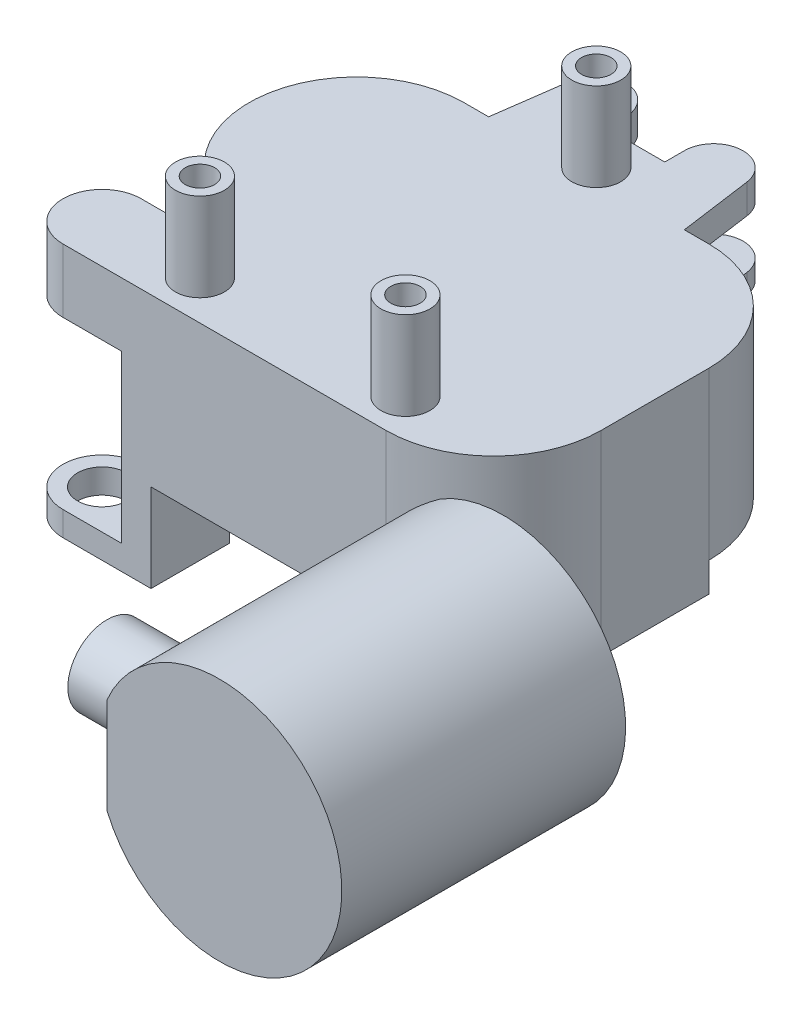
ISO-10303-21;
HEADER;
FILE_DESCRIPTION(('STEP AP214'),'2;1');
FILE_NAME('part.step','',(''),(''),'','','');
FILE_SCHEMA(('AUTOMOTIVE_DESIGN { 1 0 10303 214 1 1 1 1 }'));
ENDSEC;
DATA;
#1=APPLICATION_CONTEXT('core data for automotive mechanical design processes');
#2=APPLICATION_PROTOCOL_DEFINITION('international standard','automotive_design',2000,#1);
#3=PRODUCT_CONTEXT('',#1,'mechanical');
#4=PRODUCT('Part','Part','',(#3));
#5=PRODUCT_RELATED_PRODUCT_CATEGORY('part','',(#4));
#6=PRODUCT_DEFINITION_FORMATION('','',#4);
#7=PRODUCT_DEFINITION_CONTEXT('part definition',#1,'design');
#8=PRODUCT_DEFINITION('design','',#6,#7);
#9=PRODUCT_DEFINITION_SHAPE('','',#8);
#10=(LENGTH_UNIT() NAMED_UNIT(*) SI_UNIT(.MILLI.,.METRE.));
#11=(NAMED_UNIT(*) PLANE_ANGLE_UNIT() SI_UNIT($,.RADIAN.));
#12=(NAMED_UNIT(*) SI_UNIT($,.STERADIAN.) SOLID_ANGLE_UNIT());
#13=UNCERTAINTY_MEASURE_WITH_UNIT(LENGTH_MEASURE(1.E-05),#10,'distance_accuracy_value','');
#14=(GEOMETRIC_REPRESENTATION_CONTEXT(3) GLOBAL_UNCERTAINTY_ASSIGNED_CONTEXT((#13)) GLOBAL_UNIT_ASSIGNED_CONTEXT((#10,
#11,#12)) REPRESENTATION_CONTEXT('',''));
#15=CARTESIAN_POINT('',(0.,0.,0.));
#16=DIRECTION('',(0.,0.,1.));
#17=DIRECTION('',(1.,0.,0.));
#18=AXIS2_PLACEMENT_3D('',#15,#16,#17);
#19=CARTESIAN_POINT('',(12.,6.89897948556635,0.));
#20=DIRECTION('',(1.,0.,0.));
#21=DIRECTION('',(0.,1.,0.));
#22=AXIS2_PLACEMENT_3D('',#19,#20,#21);
#23=PLANE('',#22);
#24=CARTESIAN_POINT('',(12.,2.,20.));
#25=DIRECTION('',(1.,0.,0.));
#26=DIRECTION('',(0.,1.,0.));
#27=AXIS2_PLACEMENT_3D('',#24,#25,#26);
#28=CIRCLE('',#27,2.5);
#29=CARTESIAN_POINT('',(12.,4.5,20.));
#30=VERTEX_POINT('',#29);
#31=EDGE_CURVE('E20',#30,#30,#28,.F.);
#32=ORIENTED_EDGE('',*,*,#31,.T.);
#33=EDGE_LOOP('',(#32));
#34=FACE_BOUND('',#33,.T.);
#35=ADVANCED_FACE('F17',(#34),#23,.F.);
#36=CARTESIAN_POINT('',(4.00000000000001,2.,20.));
#37=DIRECTION('',(1.,0.,0.));
#38=DIRECTION('',(0.,1.,0.));
#39=AXIS2_PLACEMENT_3D('',#36,#37,#38);
#40=CYLINDRICAL_SURFACE('',#39,2.5);
#41=CARTESIAN_POINT('',(4.00000000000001,2.,20.));
#42=DIRECTION('',(1.,0.,0.));
#43=DIRECTION('',(0.,1.,0.));
#44=AXIS2_PLACEMENT_3D('',#41,#42,#43);
#45=CIRCLE('',#44,2.5);
#46=CARTESIAN_POINT('',(4.00000000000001,4.5,20.));
#47=VERTEX_POINT('',#46);
#48=EDGE_CURVE('E856',#47,#47,#45,.T.);
#49=ORIENTED_EDGE('',*,*,#48,.F.);
#50=EDGE_LOOP('',(#49));
#51=FACE_BOUND('',#50,.T.);
#52=ORIENTED_EDGE('',*,*,#31,.F.);
#53=EDGE_LOOP('',(#52));
#54=FACE_BOUND('',#53,.T.);
#55=ADVANCED_FACE('F864',(#51,#54),#40,.F.);
#56=CARTESIAN_POINT('',(-20.5,17.,-4.));
#57=DIRECTION('',(0.,-1.,0.));
#58=DIRECTION('',(0.,0.,-1.));
#59=AXIS2_PLACEMENT_3D('',#56,#57,#58);
#60=PLANE('',#59);
#61=CARTESIAN_POINT('',(0.,17.,-34.));
#62=DIRECTION('',(0.,-1.,0.));
#63=DIRECTION('',(0.,0.,-1.));
#64=AXIS2_PLACEMENT_3D('',#61,#62,#63);
#65=CIRCLE('',#64,1.5);
#66=CARTESIAN_POINT('',(0.,17.,-35.5));
#67=VERTEX_POINT('',#66);
#68=EDGE_CURVE('E854',#67,#67,#65,.F.);
#69=ORIENTED_EDGE('',*,*,#68,.T.);
#70=EDGE_LOOP('',(#69));
#71=FACE_BOUND('',#70,.T.);
#72=ADVANCED_FACE('F866',(#71),#60,.F.);
#73=CARTESIAN_POINT('',(-20.5,17.,-4.));
#74=DIRECTION('',(0.,-1.,0.));
#75=DIRECTION('',(0.,0.,-1.));
#76=AXIS2_PLACEMENT_3D('',#73,#74,#75);
#77=PLANE('',#76);
#78=CARTESIAN_POINT('',(-10.5,17.,-4.));
#79=DIRECTION('',(0.,-1.,0.));
#80=DIRECTION('',(0.,0.,-1.));
#81=AXIS2_PLACEMENT_3D('',#78,#79,#80);
#82=CIRCLE('',#81,1.5);
#83=CARTESIAN_POINT('',(-10.5,17.,-5.5));
#84=VERTEX_POINT('',#83);
#85=EDGE_CURVE('E851',#84,#84,#82,.F.);
#86=ORIENTED_EDGE('',*,*,#85,.T.);
#87=EDGE_LOOP('',(#86));
#88=FACE_BOUND('',#87,.T.);
#89=ADVANCED_FACE('F872',(#88),#77,.F.);
#90=CARTESIAN_POINT('',(-20.5,17.,-4.));
#91=DIRECTION('',(0.,-1.,0.));
#92=DIRECTION('',(0.,0.,-1.));
#93=AXIS2_PLACEMENT_3D('',#90,#91,#92);
#94=PLANE('',#93);
#95=CARTESIAN_POINT('',(10.5,17.,-4.));
#96=DIRECTION('',(0.,-1.,0.));
#97=DIRECTION('',(0.,0.,-1.));
#98=AXIS2_PLACEMENT_3D('',#95,#96,#97);
#99=CIRCLE('',#98,1.5);
#100=CARTESIAN_POINT('',(10.5,17.,-5.5));
#101=VERTEX_POINT('',#100);
#102=EDGE_CURVE('E848',#101,#101,#99,.F.);
#103=ORIENTED_EDGE('',*,*,#102,.T.);
#104=EDGE_LOOP('',(#103));
#105=FACE_BOUND('',#104,.T.);
#106=ADVANCED_FACE('F878',(#105),#94,.F.);
#107=CARTESIAN_POINT('',(-12.5,-2.,-22.));
#108=DIRECTION('',(0.,-1.,0.));
#109=DIRECTION('',(0.,0.,-1.));
#110=AXIS2_PLACEMENT_3D('',#107,#108,#109);
#111=PLANE('',#110);
#112=CARTESIAN_POINT('',(-12.5,-2.,-22.));
#113=DIRECTION('',(0.,1.,0.));
#114=DIRECTION('',(0.,0.,1.));
#115=AXIS2_PLACEMENT_3D('',#112,#113,#114);
#116=CIRCLE('',#115,4.99999999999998);
#117=CARTESIAN_POINT('',(-12.5,-2.,-17.));
#118=VERTEX_POINT('',#117);
#119=EDGE_CURVE('E299',#118,#118,#116,.T.);
#120=ORIENTED_EDGE('',*,*,#119,.F.);
#121=EDGE_LOOP('',(#120));
#122=FACE_BOUND('',#121,.T.);
#123=ADVANCED_FACE('F882',(#122),#111,.T.);
#124=CARTESIAN_POINT('',(4.00000000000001,2.,20.));
#125=DIRECTION('',(-1.,0.,0.));
#126=DIRECTION('',(0.,-1.,0.));
#127=AXIS2_PLACEMENT_3D('',#124,#125,#126);
#128=PLANE('',#127);
#129=ORIENTED_EDGE('',*,*,#48,.T.);
#130=EDGE_LOOP('',(#129));
#131=FACE_BOUND('',#130,.T.);
#132=CARTESIAN_POINT('',(4.00000000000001,2.,20.));
#133=DIRECTION('',(1.,0.,0.));
#134=DIRECTION('',(0.,1.,0.));
#135=AXIS2_PLACEMENT_3D('',#132,#133,#134);
#136=CIRCLE('',#135,4.);
#137=CARTESIAN_POINT('',(4.00000000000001,6.,20.));
#138=VERTEX_POINT('',#137);
#139=EDGE_CURVE('E833',#138,#138,#136,.T.);
#140=ORIENTED_EDGE('',*,*,#139,.F.);
#141=EDGE_LOOP('',(#140));
#142=FACE_BOUND('',#141,.T.);
#143=ADVANCED_FACE('F886',(#131,#142),#128,.T.);
#144=CARTESIAN_POINT('',(-20.5,12.5,-4.));
#145=DIRECTION('',(0.,-1.,0.));
#146=DIRECTION('',(0.,0.,-1.));
#147=AXIS2_PLACEMENT_3D('',#144,#145,#146);
#148=PLANE('',#147);
#149=CARTESIAN_POINT('',(-20.5,12.5,-4.));
#150=DIRECTION('',(0.,-1.,0.));
#151=DIRECTION('',(0.,0.,-1.));
#152=AXIS2_PLACEMENT_3D('',#149,#150,#151);
#153=CIRCLE('',#152,2.5);
#154=CARTESIAN_POINT('',(-20.5,12.5,-6.5));
#155=VERTEX_POINT('',#154);
#156=EDGE_CURVE('E837',#155,#155,#153,.T.);
#157=ORIENTED_EDGE('',*,*,#156,.T.);
#158=EDGE_LOOP('',(#157));
#159=FACE_BOUND('',#158,.T.);
#160=ADVANCED_FACE('F890',(#159),#148,.T.);
#161=CARTESIAN_POINT('',(0.,26.,-34.));
#162=DIRECTION('',(0.,-1.,0.));
#163=DIRECTION('',(0.,0.,-1.));
#164=AXIS2_PLACEMENT_3D('',#161,#162,#163);
#165=CYLINDRICAL_SURFACE('',#164,1.5);
#166=CARTESIAN_POINT('',(0.,26.,-34.));
#167=DIRECTION('',(0.,-1.,0.));
#168=DIRECTION('',(0.,0.,-1.));
#169=AXIS2_PLACEMENT_3D('',#166,#167,#168);
#170=CIRCLE('',#169,1.5);
#171=CARTESIAN_POINT('',(0.,26.,-35.5));
#172=VERTEX_POINT('',#171);
#173=EDGE_CURVE('E842',#172,#172,#170,.T.);
#174=ORIENTED_EDGE('',*,*,#173,.F.);
#175=EDGE_LOOP('',(#174));
#176=FACE_BOUND('',#175,.T.);
#177=ORIENTED_EDGE('',*,*,#68,.F.);
#178=EDGE_LOOP('',(#177));
#179=FACE_BOUND('',#178,.T.);
#180=ADVANCED_FACE('F893',(#176,#179),#165,.F.);
#181=CARTESIAN_POINT('',(-10.5,26.,-4.));
#182=DIRECTION('',(0.,-1.,0.));
#183=DIRECTION('',(0.,0.,-1.));
#184=AXIS2_PLACEMENT_3D('',#181,#182,#183);
#185=CYLINDRICAL_SURFACE('',#184,1.5);
#186=CARTESIAN_POINT('',(-10.5,26.,-4.));
#187=DIRECTION('',(0.,-1.,0.));
#188=DIRECTION('',(0.,0.,-1.));
#189=AXIS2_PLACEMENT_3D('',#186,#187,#188);
#190=CIRCLE('',#189,1.5);
#191=CARTESIAN_POINT('',(-10.5,26.,-5.5));
#192=VERTEX_POINT('',#191);
#193=EDGE_CURVE('E976',#192,#192,#190,.T.);
#194=ORIENTED_EDGE('',*,*,#193,.F.);
#195=EDGE_LOOP('',(#194));
#196=FACE_BOUND('',#195,.T.);
#197=ORIENTED_EDGE('',*,*,#85,.F.);
#198=EDGE_LOOP('',(#197));
#199=FACE_BOUND('',#198,.T.);
#200=ADVANCED_FACE('F897',(#196,#199),#185,.F.);
#201=CARTESIAN_POINT('',(10.5,26.,-4.));
#202=DIRECTION('',(0.,-1.,0.));
#203=DIRECTION('',(0.,0.,-1.));
#204=AXIS2_PLACEMENT_3D('',#201,#202,#203);
#205=CYLINDRICAL_SURFACE('',#204,1.5);
#206=CARTESIAN_POINT('',(10.5,26.,-4.));
#207=DIRECTION('',(0.,-1.,0.));
#208=DIRECTION('',(0.,0.,-1.));
#209=AXIS2_PLACEMENT_3D('',#206,#207,#208);
#210=CIRCLE('',#209,1.5);
#211=CARTESIAN_POINT('',(10.5,26.,-5.5));
#212=VERTEX_POINT('',#211);
#213=EDGE_CURVE('E823',#212,#212,#210,.T.);
#214=ORIENTED_EDGE('',*,*,#213,.F.);
#215=EDGE_LOOP('',(#214));
#216=FACE_BOUND('',#215,.T.);
#217=ORIENTED_EDGE('',*,*,#102,.F.);
#218=EDGE_LOOP('',(#217));
#219=FACE_BOUND('',#218,.T.);
#220=ADVANCED_FACE('F901',(#216,#219),#205,.F.);
#221=CARTESIAN_POINT('',(-12.5,3.,-22.));
#222=DIRECTION('',(0.,1.,0.));
#223=DIRECTION('',(0.,0.,1.));
#224=AXIS2_PLACEMENT_3D('',#221,#222,#223);
#225=CONICAL_SURFACE('',#224,10.,0.78539816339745);
#226=CARTESIAN_POINT('',(-12.5,3.,-22.));
#227=DIRECTION('',(0.,1.,0.));
#228=DIRECTION('',(0.,0.,1.));
#229=AXIS2_PLACEMENT_3D('',#226,#227,#228);
#230=CIRCLE('',#229,10.);
#231=CARTESIAN_POINT('',(-12.5,3.,-12.));
#232=VERTEX_POINT('',#231);
#233=EDGE_CURVE('E773',#232,#232,#230,.T.);
#234=ORIENTED_EDGE('',*,*,#233,.F.);
#235=EDGE_LOOP('',(#234));
#236=FACE_BOUND('',#235,.T.);
#237=ORIENTED_EDGE('',*,*,#119,.T.);
#238=EDGE_LOOP('',(#237));
#239=FACE_BOUND('',#238,.T.);
#240=ADVANCED_FACE('F905',(#236,#239),#225,.T.);
#241=CARTESIAN_POINT('',(5.99999999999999,17.,-40.));
#242=DIRECTION('',(0.,-1.,0.));
#243=DIRECTION('',(0.,0.,-1.));
#244=AXIS2_PLACEMENT_3D('',#241,#242,#243);
#245=CYLINDRICAL_SURFACE('',#244,3.);
#246=CARTESIAN_POINT('',(5.99999999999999,7.,-40.));
#247=DIRECTION('',(0.,-1.,0.));
#248=DIRECTION('',(0.,0.,-1.));
#249=AXIS2_PLACEMENT_3D('',#246,#247,#248);
#250=CIRCLE('',#249,3.);
#251=CARTESIAN_POINT('',(8.97153246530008,7.,-40.4123042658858));
#252=VERTEX_POINT('',#251);
#253=CARTESIAN_POINT('',(2.99999999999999,7.,-40.));
#254=VERTEX_POINT('',#253);
#255=EDGE_CURVE('E737',#252,#254,#250,.F.);
#256=ORIENTED_EDGE('',*,*,#255,.T.);
#257=DIRECTION('',(0.,1.,0.));
#258=VECTOR('',#257,1.);
#259=CARTESIAN_POINT('',(2.99999999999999,17.,-40.));
#260=LINE('',#259,#258);
#261=CARTESIAN_POINT('',(2.99999999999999,9.,-40.));
#262=VERTEX_POINT('',#261);
#263=EDGE_CURVE('E282',#254,#262,#260,.T.);
#264=ORIENTED_EDGE('',*,*,#263,.T.);
#265=CARTESIAN_POINT('',(5.99999999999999,9.,-40.));
#266=DIRECTION('',(0.,-1.,0.));
#267=DIRECTION('',(0.,0.,-1.));
#268=AXIS2_PLACEMENT_3D('',#265,#266,#267);
#269=CIRCLE('',#268,3.);
#270=CARTESIAN_POINT('',(8.97153246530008,9.,-40.4123042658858));
#271=VERTEX_POINT('',#270);
#272=EDGE_CURVE('E268',#271,#262,#269,.F.);
#273=ORIENTED_EDGE('',*,*,#272,.F.);
#274=DIRECTION('',(0.,1.,0.));
#275=VECTOR('',#274,1.);
#276=CARTESIAN_POINT('',(8.97153246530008,17.,-40.4123042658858));
#277=LINE('',#276,#275);
#278=EDGE_CURVE('E307',#271,#252,#277,.F.);
#279=ORIENTED_EDGE('',*,*,#278,.T.);
#280=EDGE_LOOP('',(#256,#264,#273,#279));
#281=FACE_BOUND('',#280,.T.);
#282=ADVANCED_FACE('F909',(#281),#245,.T.);
#283=CARTESIAN_POINT('',(2.99999999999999,17.,-40.));
#284=DIRECTION('',(1.,0.,0.));
#285=DIRECTION('',(0.,0.,-1.));
#286=AXIS2_PLACEMENT_3D('',#283,#284,#285);
#287=PLANE('',#286);
#288=ORIENTED_EDGE('',*,*,#263,.F.);
#289=DIRECTION('',(0.,0.,1.));
#290=VECTOR('',#289,1.);
#291=CARTESIAN_POINT('',(2.99999999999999,7.,0.));
#292=LINE('',#291,#290);
#293=CARTESIAN_POINT('',(2.99999999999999,7.,-38.));
#294=VERTEX_POINT('',#293);
#295=EDGE_CURVE('E277',#254,#294,#292,.T.);
#296=ORIENTED_EDGE('',*,*,#295,.T.);
#297=DIRECTION('',(0.,1.,0.));
#298=VECTOR('',#297,1.);
#299=CARTESIAN_POINT('',(2.99999999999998,17.,-38.));
#300=LINE('',#299,#298);
#301=CARTESIAN_POINT('',(2.99999999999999,9.,-38.));
#302=VERTEX_POINT('',#301);
#303=EDGE_CURVE('E274',#294,#302,#300,.T.);
#304=ORIENTED_EDGE('',*,*,#303,.T.);
#305=DIRECTION('',(0.,0.,1.));
#306=VECTOR('',#305,1.);
#307=CARTESIAN_POINT('',(2.99999999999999,9.,0.));
#308=LINE('',#307,#306);
#309=EDGE_CURVE('E259',#262,#302,#308,.T.);
#310=ORIENTED_EDGE('',*,*,#309,.F.);
#311=EDGE_LOOP('',(#288,#296,#304,#310));
#312=FACE_BOUND('',#311,.T.);
#313=ADVANCED_FACE('F275',(#312),#287,.F.);
#314=CARTESIAN_POINT('',(-3.00000000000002,17.,-38.));
#315=DIRECTION('',(0.,0.,1.));
#316=DIRECTION('',(1.,0.,0.));
#317=AXIS2_PLACEMENT_3D('',#314,#315,#316);
#318=PLANE('',#317);
#319=ORIENTED_EDGE('',*,*,#303,.F.);
#320=DIRECTION('',(1.,0.,0.));
#321=VECTOR('',#320,1.);
#322=CARTESIAN_POINT('',(0.,7.,-38.));
#323=LINE('',#322,#321);
#324=CARTESIAN_POINT('',(-3.00000000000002,7.,-38.));
#325=VERTEX_POINT('',#324);
#326=EDGE_CURVE('E316',#294,#325,#323,.F.);
#327=ORIENTED_EDGE('',*,*,#326,.T.);
#328=DIRECTION('',(0.,1.,0.));
#329=VECTOR('',#328,1.);
#330=CARTESIAN_POINT('',(-3.00000000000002,17.,-38.));
#331=LINE('',#330,#329);
#332=CARTESIAN_POINT('',(-3.00000000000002,9.,-38.));
#333=VERTEX_POINT('',#332);
#334=EDGE_CURVE('E281',#325,#333,#331,.T.);
#335=ORIENTED_EDGE('',*,*,#334,.T.);
#336=DIRECTION('',(1.,0.,0.));
#337=VECTOR('',#336,1.);
#338=CARTESIAN_POINT('',(0.,9.,-38.));
#339=LINE('',#338,#337);
#340=EDGE_CURVE('E265',#302,#333,#339,.F.);
#341=ORIENTED_EDGE('',*,*,#340,.F.);
#342=EDGE_LOOP('',(#319,#327,#335,#341));
#343=FACE_BOUND('',#342,.T.);
#344=ADVANCED_FACE('F284',(#343),#318,.F.);
#345=CARTESIAN_POINT('',(-2.99999999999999,17.,-40.));
#346=DIRECTION('',(-1.,0.,0.));
#347=DIRECTION('',(0.,0.,1.));
#348=AXIS2_PLACEMENT_3D('',#345,#346,#347);
#349=PLANE('',#348);
#350=ORIENTED_EDGE('',*,*,#334,.F.);
#351=DIRECTION('',(0.,0.,1.));
#352=VECTOR('',#351,1.);
#353=CARTESIAN_POINT('',(-3.00000000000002,7.,0.));
#354=LINE('',#353,#352);
#355=CARTESIAN_POINT('',(-3.00000000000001,7.,-40.));
#356=VERTEX_POINT('',#355);
#357=EDGE_CURVE('E318',#325,#356,#354,.F.);
#358=ORIENTED_EDGE('',*,*,#357,.T.);
#359=DIRECTION('',(0.,-1.,0.));
#360=VECTOR('',#359,1.);
#361=CARTESIAN_POINT('',(-2.99999999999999,17.,-40.));
#362=LINE('',#361,#360);
#363=CARTESIAN_POINT('',(-3.00000000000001,9.,-40.));
#364=VERTEX_POINT('',#363);
#365=EDGE_CURVE('E831',#364,#356,#362,.T.);
#366=ORIENTED_EDGE('',*,*,#365,.F.);
#367=DIRECTION('',(0.,0.,1.));
#368=VECTOR('',#367,1.);
#369=CARTESIAN_POINT('',(-3.00000000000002,9.,0.));
#370=LINE('',#369,#368);
#371=EDGE_CURVE('E286',#333,#364,#370,.F.);
#372=ORIENTED_EDGE('',*,*,#371,.F.);
#373=EDGE_LOOP('',(#350,#358,#366,#372));
#374=FACE_BOUND('',#373,.T.);
#375=ADVANCED_FACE('F918',(#374),#349,.F.);
#376=CARTESIAN_POINT('',(-5.99999999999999,17.,-40.));
#377=DIRECTION('',(0.,-1.,0.));
#378=DIRECTION('',(0.,0.,-1.));
#379=AXIS2_PLACEMENT_3D('',#376,#377,#378);
#380=CYLINDRICAL_SURFACE('',#379,3.);
#381=CARTESIAN_POINT('',(-5.99999999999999,7.,-40.));
#382=DIRECTION('',(0.,-1.,0.));
#383=DIRECTION('',(0.,0.,-1.));
#384=AXIS2_PLACEMENT_3D('',#381,#382,#383);
#385=CIRCLE('',#384,3.);
#386=CARTESIAN_POINT('',(-8.97153246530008,7.,-40.4123042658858));
#387=VERTEX_POINT('',#386);
#388=EDGE_CURVE('E724',#356,#387,#385,.F.);
#389=ORIENTED_EDGE('',*,*,#388,.T.);
#390=DIRECTION('',(0.,1.,0.));
#391=VECTOR('',#390,1.);
#392=CARTESIAN_POINT('',(-8.97153246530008,17.,-40.4123042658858));
#393=LINE('',#392,#391);
#394=CARTESIAN_POINT('',(-8.97153246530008,9.,-40.4123042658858));
#395=VERTEX_POINT('',#394);
#396=EDGE_CURVE('E703',#387,#395,#393,.T.);
#397=ORIENTED_EDGE('',*,*,#396,.T.);
#398=CARTESIAN_POINT('',(-5.99999999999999,9.,-40.));
#399=DIRECTION('',(0.,-1.,0.));
#400=DIRECTION('',(0.,0.,-1.));
#401=AXIS2_PLACEMENT_3D('',#398,#399,#400);
#402=CIRCLE('',#401,3.);
#403=EDGE_CURVE('E288',#364,#395,#402,.F.);
#404=ORIENTED_EDGE('',*,*,#403,.F.);
#405=ORIENTED_EDGE('',*,*,#365,.T.);
#406=EDGE_LOOP('',(#389,#397,#404,#405));
#407=FACE_BOUND('',#406,.T.);
#408=ADVANCED_FACE('F921',(#407),#380,.T.);
#409=CARTESIAN_POINT('',(-20.5,12.5,-4.));
#410=DIRECTION('',(0.,-1.,0.));
#411=DIRECTION('',(0.,0.,-1.));
#412=AXIS2_PLACEMENT_3D('',#409,#410,#411);
#413=CYLINDRICAL_SURFACE('',#412,2.5);
#414=CARTESIAN_POINT('',(-20.5,-6.5,-4.));
#415=DIRECTION('',(0.,-1.,0.));
#416=DIRECTION('',(0.,0.,-1.));
#417=AXIS2_PLACEMENT_3D('',#414,#415,#416);
#418=CIRCLE('',#417,2.5);
#419=CARTESIAN_POINT('',(-20.5,-6.5,-6.5));
#420=VERTEX_POINT('',#419);
#421=EDGE_CURVE('E957',#420,#420,#418,.F.);
#422=ORIENTED_EDGE('',*,*,#421,.T.);
#423=EDGE_LOOP('',(#422));
#424=FACE_BOUND('',#423,.T.);
#425=CARTESIAN_POINT('',(-20.5,-9.,-4.));
#426=DIRECTION('',(0.,-1.,0.));
#427=DIRECTION('',(0.,0.,-1.));
#428=AXIS2_PLACEMENT_3D('',#425,#426,#427);
#429=CIRCLE('',#428,2.5);
#430=CARTESIAN_POINT('',(-20.5,-9.,-6.5));
#431=VERTEX_POINT('',#430);
#432=EDGE_CURVE('E664',#431,#431,#429,.F.);
#433=ORIENTED_EDGE('',*,*,#432,.F.);
#434=EDGE_LOOP('',(#433));
#435=FACE_BOUND('',#434,.T.);
#436=ADVANCED_FACE('F925',(#424,#435),#413,.F.);
#437=CARTESIAN_POINT('',(4.00000000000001,2.,20.));
#438=DIRECTION('',(1.,0.,0.));
#439=DIRECTION('',(0.,1.,0.));
#440=AXIS2_PLACEMENT_3D('',#437,#438,#439);
#441=CYLINDRICAL_SURFACE('',#440,4.);
#442=ORIENTED_EDGE('',*,*,#139,.T.);
#443=EDGE_LOOP('',(#442));
#444=FACE_BOUND('',#443,.T.);
#445=CARTESIAN_POINT('',(12.,2.,20.));
#446=DIRECTION('',(1.,0.,0.));
#447=DIRECTION('',(0.,1.,0.));
#448=AXIS2_PLACEMENT_3D('',#445,#446,#447);
#449=CIRCLE('',#448,4.);
#450=CARTESIAN_POINT('',(12.,6.,20.));
#451=VERTEX_POINT('',#450);
#452=EDGE_CURVE('E627',#451,#451,#449,.F.);
#453=ORIENTED_EDGE('',*,*,#452,.T.);
#454=EDGE_LOOP('',(#453));
#455=FACE_BOUND('',#454,.T.);
#456=ADVANCED_FACE('F928',(#444,#455),#441,.T.);
#457=CARTESIAN_POINT('',(23.5,14.5,28.));
#458=DIRECTION('',(0.,0.,-1.));
#459=DIRECTION('',(-1.,0.,0.));
#460=AXIS2_PLACEMENT_3D('',#457,#458,#459);
#461=PLANE('',#460);
#462=CARTESIAN_POINT('',(23.5,2.,28.));
#463=DIRECTION('',(0.,0.,1.));
#464=DIRECTION('',(1.,0.,0.));
#465=AXIS2_PLACEMENT_3D('',#462,#463,#464);
#466=CIRCLE('',#465,12.5);
#467=CARTESIAN_POINT('',(12.,6.89897948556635,28.));
#468=VERTEX_POINT('',#467);
#469=CARTESIAN_POINT('',(12.,-2.89897948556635,28.));
#470=VERTEX_POINT('',#469);
#471=EDGE_CURVE('E622',#468,#470,#466,.F.);
#472=ORIENTED_EDGE('',*,*,#471,.F.);
#473=DIRECTION('',(0.,1.,0.));
#474=VECTOR('',#473,1.);
#475=CARTESIAN_POINT('',(12.,6.89897948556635,28.));
#476=LINE('',#475,#474);
#477=EDGE_CURVE('E626',#468,#470,#476,.F.);
#478=ORIENTED_EDGE('',*,*,#477,.T.);
#479=EDGE_LOOP('',(#472,#478));
#480=FACE_BOUND('',#479,.T.);
#481=ADVANCED_FACE('F932',(#480),#461,.F.);
#482=CARTESIAN_POINT('',(12.5,-3.,-11.));
#483=DIRECTION('',(0.,1.,0.));
#484=DIRECTION('',(0.,0.,1.));
#485=AXIS2_PLACEMENT_3D('',#482,#483,#484);
#486=CYLINDRICAL_SURFACE('',#485,11.);
#487=DIRECTION('',(0.,1.,0.));
#488=VECTOR('',#487,1.);
#489=CARTESIAN_POINT('',(12.5,-3.,-22.));
#490=LINE('',#489,#488);
#491=CARTESIAN_POINT('',(12.5,0.,-22.));
#492=VERTEX_POINT('',#491);
#493=CARTESIAN_POINT('',(12.5,-3.,-22.));
#494=VERTEX_POINT('',#493);
#495=EDGE_CURVE('E691',#492,#494,#490,.F.);
#496=ORIENTED_EDGE('',*,*,#495,.T.);
#497=CARTESIAN_POINT('',(12.5,-3.,-11.));
#498=DIRECTION('',(0.,1.,0.));
#499=DIRECTION('',(0.,0.,1.));
#500=AXIS2_PLACEMENT_3D('',#497,#498,#499);
#501=CIRCLE('',#500,11.);
#502=CARTESIAN_POINT('',(12.0435607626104,-3.,-0.00947393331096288));
#503=VERTEX_POINT('',#502);
#504=EDGE_CURVE('E677',#503,#494,#501,.F.);
#505=ORIENTED_EDGE('',*,*,#504,.F.);
#506=CARTESIAN_POINT('',(11.1610373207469,0.,-0.0817959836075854));
#507=CARTESIAN_POINT('',(11.202917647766,-0.258441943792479,-0.0766923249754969));
#508=CARTESIAN_POINT('',(11.2529337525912,-0.515543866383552,-0.0707705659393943));
#509=CARTESIAN_POINT('',(11.3687678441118,-1.02508502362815,-0.0581596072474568));
#510=CARTESIAN_POINT('',(11.4345231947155,-1.27753857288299,-0.0514735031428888));
#511=CARTESIAN_POINT('',(11.5816980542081,-1.77783929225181,-0.0381494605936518));
#512=CARTESIAN_POINT('',(11.6631175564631,-2.02568646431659,-0.0315115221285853));
#513=CARTESIAN_POINT('',(11.8416486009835,-2.51679492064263,-0.0193592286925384));
#514=CARTESIAN_POINT('',(11.9388205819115,-2.7600343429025,-0.0138493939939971));
#515=CARTESIAN_POINT('',(12.0435607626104,-3.,-0.00947393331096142));
#516=B_SPLINE_CURVE_WITH_KNOTS('',3,(#506,#507,#508,#509,#510,#511,#512,#513,#514,#515),
.UNSPECIFIED.,.F.,.F.,(4,2,2,2,4),(0.,0.785451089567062,1.56782688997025,2.35020235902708,
3.13565393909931),.UNSPECIFIED.);
#517=CARTESIAN_POINT('',(11.1610373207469,0.,-0.0817959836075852));
#518=VERTEX_POINT('',#517);
#519=EDGE_CURVE('E619',#518,#503,#516,.T.);
#520=ORIENTED_EDGE('',*,*,#519,.F.);
#521=CARTESIAN_POINT('',(12.5,0.,-11.));
#522=DIRECTION('',(0.,1.,0.));
#523=DIRECTION('',(0.,0.,1.));
#524=AXIS2_PLACEMENT_3D('',#521,#522,#523);
#525=CIRCLE('',#524,11.);
#526=EDGE_CURVE('E596',#492,#518,#525,.T.);
#527=ORIENTED_EDGE('',*,*,#526,.F.);
#528=EDGE_LOOP('',(#496,#505,#520,#527));
#529=FACE_BOUND('',#528,.T.);
#530=ADVANCED_FACE('F935',(#529),#486,.T.);
#531=CARTESIAN_POINT('',(-20.5,17.,-8.));
#532=DIRECTION('',(0.,0.,1.));
#533=DIRECTION('',(1.,0.,0.));
#534=AXIS2_PLACEMENT_3D('',#531,#532,#533);
#535=PLANE('',#534);
#536=DIRECTION('',(0.,-1.,0.));
#537=VECTOR('',#536,1.);
#538=CARTESIAN_POINT('',(-16.0278640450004,10.5,-8.));
#539=LINE('',#538,#537);
#540=CARTESIAN_POINT('',(-16.0278640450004,-6.5,-8.));
#541=VERTEX_POINT('',#540);
#542=CARTESIAN_POINT('',(-16.0278640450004,0.,-8.));
#543=VERTEX_POINT('',#542);
#544=EDGE_CURVE('E774',#541,#543,#539,.F.);
#545=ORIENTED_EDGE('',*,*,#544,.T.);
#546=DIRECTION('',(1.,0.,0.));
#547=VECTOR('',#546,1.);
#548=CARTESIAN_POINT('',(-20.5,0.,-8.));
#549=LINE('',#548,#547);
#550=CARTESIAN_POINT('',(-11.5,0.,-8.));
#551=VERTEX_POINT('',#550);
#552=EDGE_CURVE('E587',#551,#543,#549,.F.);
#553=ORIENTED_EDGE('',*,*,#552,.F.);
#554=DIRECTION('',(0.,1.,0.));
#555=VECTOR('',#554,1.);
#556=CARTESIAN_POINT('',(-11.5,-9.,-8.));
#557=LINE('',#556,#555);
#558=CARTESIAN_POINT('',(-11.5,-9.,-8.));
#559=VERTEX_POINT('',#558);
#560=EDGE_CURVE('E669',#551,#559,#557,.F.);
#561=ORIENTED_EDGE('',*,*,#560,.T.);
#562=DIRECTION('',(1.,0.,0.));
#563=VECTOR('',#562,1.);
#564=CARTESIAN_POINT('',(-20.5,-9.,-8.));
#565=LINE('',#564,#563);
#566=CARTESIAN_POINT('',(-20.5,-9.,-8.));
#567=VERTEX_POINT('',#566);
#568=EDGE_CURVE('E655',#567,#559,#565,.T.);
#569=ORIENTED_EDGE('',*,*,#568,.F.);
#570=DIRECTION('',(0.,-1.,0.));
#571=VECTOR('',#570,1.);
#572=CARTESIAN_POINT('',(-20.5,17.,-8.));
#573=LINE('',#572,#571);
#574=CARTESIAN_POINT('',(-20.5,-6.5,-8.));
#575=VERTEX_POINT('',#574);
#576=EDGE_CURVE('E658',#575,#567,#573,.T.);
#577=ORIENTED_EDGE('',*,*,#576,.F.);
#578=DIRECTION('',(1.,0.,0.));
#579=VECTOR('',#578,1.);
#580=CARTESIAN_POINT('',(-20.5,-6.5,-8.));
#581=LINE('',#580,#579);
#582=EDGE_CURVE('E645',#575,#541,#581,.T.);
#583=ORIENTED_EDGE('',*,*,#582,.T.);
#584=EDGE_LOOP('',(#545,#553,#561,#569,#577,#583));
#585=FACE_BOUND('',#584,.T.);
#586=ADVANCED_FACE('F940',(#585),#535,.F.);
#587=CARTESIAN_POINT('',(-20.5,12.5,-4.));
#588=DIRECTION('',(0.,-1.,0.));
#589=DIRECTION('',(0.,0.,-1.));
#590=AXIS2_PLACEMENT_3D('',#587,#588,#589);
#591=CYLINDRICAL_SURFACE('',#590,2.5);
#592=CARTESIAN_POINT('',(-20.5,10.5,-4.));
#593=DIRECTION('',(0.,-1.,0.));
#594=DIRECTION('',(0.,0.,-1.));
#595=AXIS2_PLACEMENT_3D('',#592,#593,#594);
#596=CIRCLE('',#595,2.5);
#597=CARTESIAN_POINT('',(-20.5,10.5,-6.5));
#598=VERTEX_POINT('',#597);
#599=EDGE_CURVE('E590',#598,#598,#596,.F.);
#600=ORIENTED_EDGE('',*,*,#599,.F.);
#601=EDGE_LOOP('',(#600));
#602=FACE_BOUND('',#601,.T.);
#603=ORIENTED_EDGE('',*,*,#156,.F.);
#604=EDGE_LOOP('',(#603));
#605=FACE_BOUND('',#604,.T.);
#606=ADVANCED_FACE('F987',(#602,#605),#591,.F.);
#607=CARTESIAN_POINT('',(0.,26.,-34.));
#608=DIRECTION('',(0.,1.,0.));
#609=DIRECTION('',(0.,0.,1.));
#610=AXIS2_PLACEMENT_3D('',#607,#608,#609);
#611=PLANE('',#610);
#612=ORIENTED_EDGE('',*,*,#173,.T.);
#613=EDGE_LOOP('',(#612));
#614=FACE_BOUND('',#613,.T.);
#615=CARTESIAN_POINT('',(0.,26.,-34.));
#616=DIRECTION('',(0.,-1.,0.));
#617=DIRECTION('',(0.,0.,-1.));
#618=AXIS2_PLACEMENT_3D('',#615,#616,#617);
#619=CIRCLE('',#618,2.5);
#620=CARTESIAN_POINT('',(0.,26.,-36.5));
#621=VERTEX_POINT('',#620);
#622=EDGE_CURVE('E583',#621,#621,#619,.T.);
#623=ORIENTED_EDGE('',*,*,#622,.F.);
#624=EDGE_LOOP('',(#623));
#625=FACE_BOUND('',#624,.T.);
#626=ADVANCED_FACE('F981',(#614,#625),#611,.T.);
#627=CARTESIAN_POINT('',(-10.5,26.,-4.));
#628=DIRECTION('',(0.,1.,0.));
#629=DIRECTION('',(0.,0.,1.));
#630=AXIS2_PLACEMENT_3D('',#627,#628,#629);
#631=PLANE('',#630);
#632=ORIENTED_EDGE('',*,*,#193,.T.);
#633=EDGE_LOOP('',(#632));
#634=FACE_BOUND('',#633,.T.);
#635=CARTESIAN_POINT('',(-10.5,26.,-4.));
#636=DIRECTION('',(0.,-1.,0.));
#637=DIRECTION('',(0.,0.,-1.));
#638=AXIS2_PLACEMENT_3D('',#635,#636,#637);
#639=CIRCLE('',#638,2.5);
#640=CARTESIAN_POINT('',(-10.5,26.,-6.5));
#641=VERTEX_POINT('',#640);
#642=EDGE_CURVE('E991',#641,#641,#639,.T.);
#643=ORIENTED_EDGE('',*,*,#642,.F.);
#644=EDGE_LOOP('',(#643));
#645=FACE_BOUND('',#644,.T.);
#646=ADVANCED_FACE('F986',(#634,#645),#631,.T.);
#647=CARTESIAN_POINT('',(10.5,26.,-4.));
#648=DIRECTION('',(0.,1.,0.));
#649=DIRECTION('',(0.,0.,1.));
#650=AXIS2_PLACEMENT_3D('',#647,#648,#649);
#651=PLANE('',#650);
#652=ORIENTED_EDGE('',*,*,#213,.T.);
#653=EDGE_LOOP('',(#652));
#654=FACE_BOUND('',#653,.T.);
#655=CARTESIAN_POINT('',(10.5,26.,-4.));
#656=DIRECTION('',(0.,-1.,0.));
#657=DIRECTION('',(0.,0.,-1.));
#658=AXIS2_PLACEMENT_3D('',#655,#656,#657);
#659=CIRCLE('',#658,2.5);
#660=CARTESIAN_POINT('',(10.5,26.,-6.5));
#661=VERTEX_POINT('',#660);
#662=EDGE_CURVE('E571',#661,#661,#659,.T.);
#663=ORIENTED_EDGE('',*,*,#662,.F.);
#664=EDGE_LOOP('',(#663));
#665=FACE_BOUND('',#664,.T.);
#666=ADVANCED_FACE('F1075',(#654,#665),#651,.T.);
#667=CARTESIAN_POINT('',(-12.5,3.,-22.));
#668=DIRECTION('',(0.,-1.,0.));
#669=DIRECTION('',(0.,0.,-1.));
#670=AXIS2_PLACEMENT_3D('',#667,#668,#669);
#671=CYLINDRICAL_SURFACE('',#670,11.);
#672=DIRECTION('',(0.,1.,0.));
#673=VECTOR('',#672,1.);
#674=CARTESIAN_POINT('',(-1.50000000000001,3.,-22.));
#675=LINE('',#674,#673);
#676=CARTESIAN_POINT('',(-1.5,0.,-22.));
#677=VERTEX_POINT('',#676);
#678=CARTESIAN_POINT('',(-1.5,3.,-22.0000000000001));
#679=VERTEX_POINT('',#678);
#680=EDGE_CURVE('E241',#677,#679,#675,.T.);
#681=ORIENTED_EDGE('',*,*,#680,.F.);
#682=CARTESIAN_POINT('',(-12.5,0.,-22.));
#683=DIRECTION('',(0.,-1.,0.));
#684=DIRECTION('',(0.,0.,-1.));
#685=AXIS2_PLACEMENT_3D('',#682,#683,#684);
#686=CIRCLE('',#685,11.);
#687=CARTESIAN_POINT('',(-17.5,0.,-12.2020410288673));
#688=VERTEX_POINT('',#687);
#689=EDGE_CURVE('E603',#688,#677,#686,.F.);
#690=ORIENTED_EDGE('',*,*,#689,.F.);
#691=DIRECTION('',(0.,1.,0.));
#692=VECTOR('',#691,1.);
#693=CARTESIAN_POINT('',(-17.5,17.,-12.2020410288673));
#694=LINE('',#693,#692);
#695=CARTESIAN_POINT('',(-17.5,3.,-12.2020410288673));
#696=VERTEX_POINT('',#695);
#697=EDGE_CURVE('E565',#688,#696,#694,.T.);
#698=ORIENTED_EDGE('',*,*,#697,.T.);
#699=CARTESIAN_POINT('',(-12.5,3.,-22.));
#700=DIRECTION('',(0.,-1.,0.));
#701=DIRECTION('',(0.,0.,-1.));
#702=AXIS2_PLACEMENT_3D('',#699,#700,#701);
#703=CIRCLE('',#702,11.);
#704=EDGE_CURVE('E821',#679,#696,#703,.T.);
#705=ORIENTED_EDGE('',*,*,#704,.F.);
#706=EDGE_LOOP('',(#681,#690,#698,#705));
#707=FACE_BOUND('',#706,.T.);
#708=ADVANCED_FACE('F1077',(#707),#671,.F.);
#709=CARTESIAN_POINT('',(-20.5,10.5,-4.));
#710=DIRECTION('',(0.,-1.,0.));
#711=DIRECTION('',(0.,0.,-1.));
#712=AXIS2_PLACEMENT_3D('',#709,#710,#711);
#713=CYLINDRICAL_SURFACE('',#712,6.);
#714=ORIENTED_EDGE('',*,*,#544,.F.);
#715=CARTESIAN_POINT('',(-20.5,-6.5,-4.));
#716=DIRECTION('',(0.,-1.,0.));
#717=DIRECTION('',(0.,0.,-1.));
#718=AXIS2_PLACEMENT_3D('',#715,#716,#717);
#719=CIRCLE('',#718,6.);
#720=CARTESIAN_POINT('',(-14.5,-6.5,-4.));
#721=VERTEX_POINT('',#720);
#722=EDGE_CURVE('E637',#541,#721,#719,.T.);
#723=ORIENTED_EDGE('',*,*,#722,.T.);
#724=DIRECTION('',(0.,1.,0.));
#725=VECTOR('',#724,1.);
#726=CARTESIAN_POINT('',(-14.5,10.5,-4.));
#727=LINE('',#726,#725);
#728=CARTESIAN_POINT('',(-14.5,10.5,-4.));
#729=VERTEX_POINT('',#728);
#730=EDGE_CURVE('E636',#721,#729,#727,.T.);
#731=ORIENTED_EDGE('',*,*,#730,.T.);
#732=CARTESIAN_POINT('',(-20.5,10.5,-4.));
#733=DIRECTION('',(0.,-1.,0.));
#734=DIRECTION('',(0.,0.,-1.));
#735=AXIS2_PLACEMENT_3D('',#732,#733,#734);
#736=CIRCLE('',#735,6.);
#737=CARTESIAN_POINT('',(-17.5,10.5,-9.19615242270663));
#738=VERTEX_POINT('',#737);
#739=EDGE_CURVE('E584',#738,#729,#736,.T.);
#740=ORIENTED_EDGE('',*,*,#739,.F.);
#741=DIRECTION('',(0.,1.,0.));
#742=VECTOR('',#741,1.);
#743=CARTESIAN_POINT('',(-17.5,17.,-9.19615242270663));
#744=LINE('',#743,#742);
#745=CARTESIAN_POINT('',(-17.5,0.,-9.19615242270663));
#746=VERTEX_POINT('',#745);
#747=EDGE_CURVE('E801',#738,#746,#744,.F.);
#748=ORIENTED_EDGE('',*,*,#747,.T.);
#749=CARTESIAN_POINT('',(-20.5,0.,-4.));
#750=DIRECTION('',(0.,-1.,0.));
#751=DIRECTION('',(0.,0.,-1.));
#752=AXIS2_PLACEMENT_3D('',#749,#750,#751);
#753=CIRCLE('',#752,6.);
#754=EDGE_CURVE('E618',#543,#746,#753,.F.);
#755=ORIENTED_EDGE('',*,*,#754,.F.);
#756=EDGE_LOOP('',(#714,#723,#731,#740,#748,#755));
#757=FACE_BOUND('',#756,.T.);
#758=ADVANCED_FACE('F1008',(#757),#713,.F.);
#759=CARTESIAN_POINT('',(10.,9.,-18.));
#760=DIRECTION('',(0.,0.,1.));
#761=DIRECTION('',(1.,0.,0.));
#762=AXIS2_PLACEMENT_3D('',#759,#760,#761);
#763=PLANE('',#762);
#764=DIRECTION('',(0.,1.,0.));
#765=VECTOR('',#764,1.);
#766=CARTESIAN_POINT('',(10.,9.,-18.));
#767=LINE('',#766,#765);
#768=CARTESIAN_POINT('',(10.,14.,-18.));
#769=VERTEX_POINT('',#768);
#770=CARTESIAN_POINT('',(10.,9.,-18.));
#771=VERTEX_POINT('',#770);
#772=EDGE_CURVE('E311',#769,#771,#767,.F.);
#773=ORIENTED_EDGE('',*,*,#772,.T.);
#774=DIRECTION('',(1.,0.,0.));
#775=VECTOR('',#774,1.);
#776=CARTESIAN_POINT('',(0.,9.,-18.));
#777=LINE('',#776,#775);
#778=CARTESIAN_POINT('',(-22.7469507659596,9.,-18.));
#779=VERTEX_POINT('',#778);
#780=EDGE_CURVE('E304',#779,#771,#777,.T.);
#781=ORIENTED_EDGE('',*,*,#780,.F.);
#782=DIRECTION('',(0.,-1.,0.));
#783=VECTOR('',#782,1.);
#784=CARTESIAN_POINT('',(-22.7469507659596,17.,-18.));
#785=LINE('',#784,#783);
#786=CARTESIAN_POINT('',(-22.7469507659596,14.,-18.));
#787=VERTEX_POINT('',#786);
#788=EDGE_CURVE('E556',#787,#779,#785,.T.);
#789=ORIENTED_EDGE('',*,*,#788,.F.);
#790=DIRECTION('',(1.,0.,0.));
#791=VECTOR('',#790,1.);
#792=CARTESIAN_POINT('',(0.,14.,-18.));
#793=LINE('',#792,#791);
#794=EDGE_CURVE('E248',#787,#769,#793,.T.);
#795=ORIENTED_EDGE('',*,*,#794,.T.);
#796=EDGE_LOOP('',(#773,#781,#789,#795));
#797=FACE_BOUND('',#796,.T.);
#798=ADVANCED_FACE('F1217',(#797),#763,.F.);
#799=CARTESIAN_POINT('',(0.,14.,0.));
#800=DIRECTION('',(0.,1.,0.));
#801=DIRECTION('',(0.,0.,1.));
#802=AXIS2_PLACEMENT_3D('',#799,#800,#801);
#803=PLANE('',#802);
#804=DIRECTION('',(1.,0.,0.));
#805=VECTOR('',#804,1.);
#806=CARTESIAN_POINT('',(-12.5,14.,-33.));
#807=LINE('',#806,#805);
#808=CARTESIAN_POINT('',(-12.5,14.,-33.));
#809=VERTEX_POINT('',#808);
#810=CARTESIAN_POINT('',(-10.,14.,-33.));
#811=VERTEX_POINT('',#810);
#812=EDGE_CURVE('E550',#809,#811,#807,.T.);
#813=ORIENTED_EDGE('',*,*,#812,.T.);
#814=DIRECTION('',(0.137434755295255,0.,-0.990510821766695));
#815=VECTOR('',#814,1.);
#816=CARTESIAN_POINT('',(-10.,14.,-33.));
#817=LINE('',#816,#815);
#818=CARTESIAN_POINT('',(-8.97153246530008,14.,-40.4123042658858));
#819=VERTEX_POINT('',#818);
#820=EDGE_CURVE('E546',#811,#819,#817,.T.);
#821=ORIENTED_EDGE('',*,*,#820,.T.);
#822=CARTESIAN_POINT('',(-5.99999999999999,14.,-40.));
#823=DIRECTION('',(0.,-1.,0.));
#824=DIRECTION('',(0.,0.,-1.));
#825=AXIS2_PLACEMENT_3D('',#822,#823,#824);
#826=CIRCLE('',#825,3.);
#827=CARTESIAN_POINT('',(-2.99999999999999,14.,-40.));
#828=VERTEX_POINT('',#827);
#829=EDGE_CURVE('E543',#828,#819,#826,.F.);
#830=ORIENTED_EDGE('',*,*,#829,.F.);
#831=DIRECTION('',(0.,0.,1.));
#832=VECTOR('',#831,1.);
#833=CARTESIAN_POINT('',(-2.99999999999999,14.,-40.));
#834=LINE('',#833,#832);
#835=CARTESIAN_POINT('',(-3.00000000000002,14.,-38.));
#836=VERTEX_POINT('',#835);
#837=EDGE_CURVE('E537',#828,#836,#834,.T.);
#838=ORIENTED_EDGE('',*,*,#837,.T.);
#839=DIRECTION('',(1.,0.,0.));
#840=VECTOR('',#839,1.);
#841=CARTESIAN_POINT('',(-3.00000000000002,14.,-38.));
#842=LINE('',#841,#840);
#843=CARTESIAN_POINT('',(2.99999999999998,14.,-38.));
#844=VERTEX_POINT('',#843);
#845=EDGE_CURVE('E526',#836,#844,#842,.T.);
#846=ORIENTED_EDGE('',*,*,#845,.T.);
#847=DIRECTION('',(0.,0.,-1.));
#848=VECTOR('',#847,1.);
#849=CARTESIAN_POINT('',(2.99999999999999,14.,-40.));
#850=LINE('',#849,#848);
#851=CARTESIAN_POINT('',(2.99999999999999,14.,-40.));
#852=VERTEX_POINT('',#851);
#853=EDGE_CURVE('E522',#844,#852,#850,.T.);
#854=ORIENTED_EDGE('',*,*,#853,.T.);
#855=CARTESIAN_POINT('',(5.99999999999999,14.,-40.));
#856=DIRECTION('',(0.,-1.,0.));
#857=DIRECTION('',(0.,0.,-1.));
#858=AXIS2_PLACEMENT_3D('',#855,#856,#857);
#859=CIRCLE('',#858,3.);
#860=CARTESIAN_POINT('',(8.97153246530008,14.,-40.4123042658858));
#861=VERTEX_POINT('',#860);
#862=EDGE_CURVE('E519',#861,#852,#859,.F.);
#863=ORIENTED_EDGE('',*,*,#862,.F.);
#864=DIRECTION('',(0.137434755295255,0.,0.990510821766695));
#865=VECTOR('',#864,1.);
#866=CARTESIAN_POINT('',(10.,14.,-33.));
#867=LINE('',#866,#865);
#868=CARTESIAN_POINT('',(10.,14.,-33.0000000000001));
#869=VERTEX_POINT('',#868);
#870=EDGE_CURVE('E518',#861,#869,#867,.T.);
#871=ORIENTED_EDGE('',*,*,#870,.T.);
#872=DIRECTION('',(0.,0.,-1.));
#873=VECTOR('',#872,1.);
#874=CARTESIAN_POINT('',(10.,14.,-18.));
#875=LINE('',#874,#873);
#876=EDGE_CURVE('E313',#869,#769,#875,.F.);
#877=ORIENTED_EDGE('',*,*,#876,.T.);
#878=ORIENTED_EDGE('',*,*,#794,.F.);
#879=CARTESIAN_POINT('',(-12.5,14.,-22.));
#880=DIRECTION('',(0.,-1.,0.));
#881=DIRECTION('',(0.,0.,-1.));
#882=AXIS2_PLACEMENT_3D('',#879,#880,#881);
#883=CIRCLE('',#882,11.);
#884=EDGE_CURVE('E559',#809,#787,#883,.F.);
#885=ORIENTED_EDGE('',*,*,#884,.F.);
#886=EDGE_LOOP('',(#813,#821,#830,#838,#846,#854,#863,#871,#877,#878,#885));
#887=FACE_BOUND('',#886,.T.);
#888=ADVANCED_FACE('F1138',(#887),#803,.F.);
#889=CARTESIAN_POINT('',(0.,3.,0.));
#890=DIRECTION('',(0.,-1.,0.));
#891=DIRECTION('',(0.,0.,-1.));
#892=AXIS2_PLACEMENT_3D('',#889,#890,#891);
#893=PLANE('',#892);
#894=CARTESIAN_POINT('',(-12.5,3.,-22.));
#895=DIRECTION('',(0.,-1.,0.));
#896=DIRECTION('',(0.,0.,-1.));
#897=AXIS2_PLACEMENT_3D('',#894,#895,#896);
#898=CIRCLE('',#897,11.);
#899=CARTESIAN_POINT('',(-12.5,3.,-33.));
#900=VERTEX_POINT('',#899);
#901=EDGE_CURVE('E560',#900,#696,#898,.F.);
#902=ORIENTED_EDGE('',*,*,#901,.F.);
#903=DIRECTION('',(1.,0.,0.));
#904=VECTOR('',#903,1.);
#905=CARTESIAN_POINT('',(-12.5,3.,-33.));
#906=LINE('',#905,#904);
#907=CARTESIAN_POINT('',(-1.25,3.,-33.0000000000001));
#908=VERTEX_POINT('',#907);
#909=EDGE_CURVE('E709',#900,#908,#906,.T.);
#910=ORIENTED_EDGE('',*,*,#909,.T.);
#911=DIRECTION('',(-0.0227214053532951,0.,0.999741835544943));
#912=VECTOR('',#911,1.);
#913=CARTESIAN_POINT('',(-1.99896747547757,3.,-0.0454310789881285));
#914=LINE('',#913,#912);
#915=EDGE_CURVE('E754',#679,#908,#914,.F.);
#916=ORIENTED_EDGE('',*,*,#915,.F.);
#917=ORIENTED_EDGE('',*,*,#704,.T.);
#918=EDGE_LOOP('',(#902,#910,#916,#917));
#919=FACE_BOUND('',#918,.T.);
#920=ORIENTED_EDGE('',*,*,#233,.T.);
#921=EDGE_LOOP('',(#920));
#922=FACE_BOUND('',#921,.T.);
#923=ADVANCED_FACE('F1181',(#919,#922),#893,.T.);
#924=CARTESIAN_POINT('',(-1.99896747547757,3.,-0.0454310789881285));
#925=DIRECTION('',(-0.999741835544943,0.,-0.0227214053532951));
#926=DIRECTION('',(-0.0227214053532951,0.,0.999741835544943));
#927=AXIS2_PLACEMENT_3D('',#924,#925,#926);
#928=PLANE('',#927);
#929=ORIENTED_EDGE('',*,*,#915,.T.);
#930=DIRECTION('',(0.,1.,0.));
#931=VECTOR('',#930,1.);
#932=CARTESIAN_POINT('',(-1.25,17.,-33.0000000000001));
#933=LINE('',#932,#931);
#934=CARTESIAN_POINT('',(-1.25,0.,-33.0000000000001));
#935=VERTEX_POINT('',#934);
#936=EDGE_CURVE('E686',#908,#935,#933,.F.);
#937=ORIENTED_EDGE('',*,*,#936,.T.);
#938=DIRECTION('',(0.0227214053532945,0.,-0.999741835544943));
#939=VECTOR('',#938,1.);
#940=CARTESIAN_POINT('',(-1.5,0.,-22.));
#941=LINE('',#940,#939);
#942=EDGE_CURVE('E600',#677,#935,#941,.T.);
#943=ORIENTED_EDGE('',*,*,#942,.F.);
#944=ORIENTED_EDGE('',*,*,#680,.T.);
#945=EDGE_LOOP('',(#929,#937,#943,#944));
#946=FACE_BOUND('',#945,.T.);
#947=ADVANCED_FACE('F1184',(#946),#928,.T.);
#948=CARTESIAN_POINT('',(10.,9.,-18.));
#949=DIRECTION('',(1.,0.,0.));
#950=DIRECTION('',(0.,0.,-1.));
#951=AXIS2_PLACEMENT_3D('',#948,#949,#950);
#952=PLANE('',#951);
#953=ORIENTED_EDGE('',*,*,#772,.F.);
#954=ORIENTED_EDGE('',*,*,#876,.F.);
#955=DIRECTION('',(0.,1.,0.));
#956=VECTOR('',#955,1.);
#957=CARTESIAN_POINT('',(10.,17.,-33.0000000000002));
#958=LINE('',#957,#956);
#959=CARTESIAN_POINT('',(10.,9.,-33.0000000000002));
#960=VERTEX_POINT('',#959);
#961=EDGE_CURVE('E511',#869,#960,#958,.F.);
#962=ORIENTED_EDGE('',*,*,#961,.T.);
#963=DIRECTION('',(0.,0.,1.));
#964=VECTOR('',#963,1.);
#965=CARTESIAN_POINT('',(10.,9.,0.));
#966=LINE('',#965,#964);
#967=EDGE_CURVE('E300',#771,#960,#966,.F.);
#968=ORIENTED_EDGE('',*,*,#967,.F.);
#969=EDGE_LOOP('',(#953,#954,#962,#968));
#970=FACE_BOUND('',#969,.T.);
#971=ADVANCED_FACE('F1132',(#970),#952,.F.);
#972=CARTESIAN_POINT('',(10.,17.,-33.));
#973=DIRECTION('',(-0.990510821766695,0.,0.137434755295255));
#974=DIRECTION('',(0.137434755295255,0.,0.990510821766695));
#975=AXIS2_PLACEMENT_3D('',#972,#973,#974);
#976=PLANE('',#975);
#977=DIRECTION('',(0.,1.,0.));
#978=VECTOR('',#977,1.);
#979=CARTESIAN_POINT('',(10.,17.,-33.0000000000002));
#980=LINE('',#979,#978);
#981=CARTESIAN_POINT('',(10.,7.,-33.0000000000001));
#982=VERTEX_POINT('',#981);
#983=EDGE_CURVE('E729',#960,#982,#980,.F.);
#984=ORIENTED_EDGE('',*,*,#983,.T.);
#985=DIRECTION('',(-0.137434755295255,0.,-0.990510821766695));
#986=VECTOR('',#985,1.);
#987=CARTESIAN_POINT('',(10.,7.,-33.));
#988=LINE('',#987,#986);
#989=EDGE_CURVE('E310',#982,#252,#988,.T.);
#990=ORIENTED_EDGE('',*,*,#989,.T.);
#991=ORIENTED_EDGE('',*,*,#278,.F.);
#992=DIRECTION('',(-0.137434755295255,0.,-0.990510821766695));
#993=VECTOR('',#992,1.);
#994=CARTESIAN_POINT('',(10.,9.,-33.));
#995=LINE('',#994,#993);
#996=EDGE_CURVE('E303',#960,#271,#995,.T.);
#997=ORIENTED_EDGE('',*,*,#996,.F.);
#998=EDGE_LOOP('',(#984,#990,#991,#997));
#999=FACE_BOUND('',#998,.T.);
#1000=ADVANCED_FACE('F1199',(#999),#976,.F.);
#1001=CARTESIAN_POINT('',(0.,7.,0.));
#1002=DIRECTION('',(0.,1.,0.));
#1003=DIRECTION('',(0.,0.,1.));
#1004=AXIS2_PLACEMENT_3D('',#1001,#1002,#1003);
#1005=PLANE('',#1004);
#1006=DIRECTION('',(0.137434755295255,0.,-0.990510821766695));
#1007=VECTOR('',#1006,1.);
#1008=CARTESIAN_POINT('',(-10.,7.,-33.));
#1009=LINE('',#1008,#1007);
#1010=CARTESIAN_POINT('',(-9.99999999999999,7.,-33.));
#1011=VERTEX_POINT('',#1010);
#1012=EDGE_CURVE('E721',#1011,#387,#1009,.T.);
#1013=ORIENTED_EDGE('',*,*,#1012,.T.);
#1014=ORIENTED_EDGE('',*,*,#388,.F.);
#1015=ORIENTED_EDGE('',*,*,#357,.F.);
#1016=ORIENTED_EDGE('',*,*,#326,.F.);
#1017=ORIENTED_EDGE('',*,*,#295,.F.);
#1018=ORIENTED_EDGE('',*,*,#255,.F.);
#1019=ORIENTED_EDGE('',*,*,#989,.F.);
#1020=DIRECTION('',(1.,0.,0.));
#1021=VECTOR('',#1020,1.);
#1022=CARTESIAN_POINT('',(-12.5,7.,-33.));
#1023=LINE('',#1022,#1021);
#1024=EDGE_CURVE('E718',#982,#1011,#1023,.F.);
#1025=ORIENTED_EDGE('',*,*,#1024,.T.);
#1026=EDGE_LOOP('',(#1013,#1014,#1015,#1016,#1017,#1018,#1019,#1025));
#1027=FACE_BOUND('',#1026,.T.);
#1028=ADVANCED_FACE('F1196',(#1027),#1005,.F.);
#1029=CARTESIAN_POINT('',(-10.,17.,-33.));
#1030=DIRECTION('',(0.990510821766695,0.,0.137434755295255));
#1031=DIRECTION('',(0.137434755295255,0.,-0.990510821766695));
#1032=AXIS2_PLACEMENT_3D('',#1029,#1030,#1031);
#1033=PLANE('',#1032);
#1034=ORIENTED_EDGE('',*,*,#396,.F.);
#1035=ORIENTED_EDGE('',*,*,#1012,.F.);
#1036=DIRECTION('',(0.,1.,0.));
#1037=VECTOR('',#1036,1.);
#1038=CARTESIAN_POINT('',(-9.99999999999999,17.,-33.));
#1039=LINE('',#1038,#1037);
#1040=CARTESIAN_POINT('',(-10.,9.,-33.));
#1041=VERTEX_POINT('',#1040);
#1042=EDGE_CURVE('E713',#1011,#1041,#1039,.T.);
#1043=ORIENTED_EDGE('',*,*,#1042,.T.);
#1044=DIRECTION('',(-0.137434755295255,0.,0.990510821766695));
#1045=VECTOR('',#1044,1.);
#1046=CARTESIAN_POINT('',(-8.97153246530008,9.,-40.4123042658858));
#1047=LINE('',#1046,#1045);
#1048=EDGE_CURVE('E689',#395,#1041,#1047,.T.);
#1049=ORIENTED_EDGE('',*,*,#1048,.F.);
#1050=EDGE_LOOP('',(#1034,#1035,#1043,#1049));
#1051=FACE_BOUND('',#1050,.T.);
#1052=ADVANCED_FACE('F1194',(#1051),#1033,.F.);
#1053=CARTESIAN_POINT('',(0.,9.,0.));
#1054=DIRECTION('',(0.,1.,0.));
#1055=DIRECTION('',(0.,0.,1.));
#1056=AXIS2_PLACEMENT_3D('',#1053,#1054,#1055);
#1057=PLANE('',#1056);
#1058=ORIENTED_EDGE('',*,*,#1048,.T.);
#1059=DIRECTION('',(1.,0.,0.));
#1060=VECTOR('',#1059,1.);
#1061=CARTESIAN_POINT('',(-12.5,9.,-33.));
#1062=LINE('',#1061,#1060);
#1063=CARTESIAN_POINT('',(-12.5,9.,-33.));
#1064=VERTEX_POINT('',#1063);
#1065=EDGE_CURVE('E710',#1041,#1064,#1062,.F.);
#1066=ORIENTED_EDGE('',*,*,#1065,.T.);
#1067=CARTESIAN_POINT('',(-12.5,9.,-22.));
#1068=DIRECTION('',(0.,-1.,0.));
#1069=DIRECTION('',(0.,0.,-1.));
#1070=AXIS2_PLACEMENT_3D('',#1067,#1068,#1069);
#1071=CIRCLE('',#1070,11.);
#1072=EDGE_CURVE('E807',#779,#1064,#1071,.T.);
#1073=ORIENTED_EDGE('',*,*,#1072,.F.);
#1074=ORIENTED_EDGE('',*,*,#780,.T.);
#1075=ORIENTED_EDGE('',*,*,#967,.T.);
#1076=ORIENTED_EDGE('',*,*,#996,.T.);
#1077=ORIENTED_EDGE('',*,*,#272,.T.);
#1078=ORIENTED_EDGE('',*,*,#309,.T.);
#1079=ORIENTED_EDGE('',*,*,#340,.T.);
#1080=ORIENTED_EDGE('',*,*,#371,.T.);
#1081=ORIENTED_EDGE('',*,*,#403,.T.);
#1082=EDGE_LOOP('',(#1058,#1066,#1073,#1074,#1075,#1076,#1077,#1078,#1079,#1080,#1081));
#1083=FACE_BOUND('',#1082,.T.);
#1084=ADVANCED_FACE('F262',(#1083),#1057,.T.);
#1085=CARTESIAN_POINT('',(12.5,-3.,-22.));
#1086=DIRECTION('',(0.,0.,1.));
#1087=DIRECTION('',(1.,0.,0.));
#1088=AXIS2_PLACEMENT_3D('',#1085,#1086,#1087);
#1089=PLANE('',#1088);
#1090=DIRECTION('',(0.,1.,0.));
#1091=VECTOR('',#1090,1.);
#1092=CARTESIAN_POINT('',(23.5,17.,-22.));
#1093=LINE('',#1092,#1091);
#1094=CARTESIAN_POINT('',(23.5,0.,-22.));
#1095=VERTEX_POINT('',#1094);
#1096=CARTESIAN_POINT('',(23.5,-3.,-22.));
#1097=VERTEX_POINT('',#1096);
#1098=EDGE_CURVE('E504',#1095,#1097,#1093,.F.);
#1099=ORIENTED_EDGE('',*,*,#1098,.T.);
#1100=DIRECTION('',(1.,0.,0.));
#1101=VECTOR('',#1100,1.);
#1102=CARTESIAN_POINT('',(12.5,-3.,-22.));
#1103=LINE('',#1102,#1101);
#1104=EDGE_CURVE('E674',#494,#1097,#1103,.T.);
#1105=ORIENTED_EDGE('',*,*,#1104,.F.);
#1106=ORIENTED_EDGE('',*,*,#495,.F.);
#1107=DIRECTION('',(1.,0.,0.));
#1108=VECTOR('',#1107,1.);
#1109=CARTESIAN_POINT('',(-20.5,0.,-22.));
#1110=LINE('',#1109,#1108);
#1111=EDGE_CURVE('E597',#1095,#492,#1110,.F.);
#1112=ORIENTED_EDGE('',*,*,#1111,.F.);
#1113=EDGE_LOOP('',(#1099,#1105,#1106,#1112));
#1114=FACE_BOUND('',#1113,.T.);
#1115=ADVANCED_FACE('F1061',(#1114),#1089,.F.);
#1116=CARTESIAN_POINT('',(12.5,-3.,-11.));
#1117=DIRECTION('',(0.,-1.,0.));
#1118=DIRECTION('',(0.,0.,-1.));
#1119=AXIS2_PLACEMENT_3D('',#1116,#1117,#1118);
#1120=PLANE('',#1119);
#1121=ORIENTED_EDGE('',*,*,#1104,.T.);
#1122=DIRECTION('',(0.,0.,1.));
#1123=VECTOR('',#1122,1.);
#1124=CARTESIAN_POINT('',(23.5,-3.,-22.));
#1125=LINE('',#1124,#1123);
#1126=CARTESIAN_POINT('',(23.5,-3.,-11.));
#1127=VERTEX_POINT('',#1126);
#1128=EDGE_CURVE('E497',#1097,#1127,#1125,.T.);
#1129=ORIENTED_EDGE('',*,*,#1128,.T.);
#1130=CARTESIAN_POINT('',(12.5,-3.,-11.));
#1131=DIRECTION('',(0.,-1.,0.));
#1132=DIRECTION('',(0.,0.,-1.));
#1133=AXIS2_PLACEMENT_3D('',#1130,#1131,#1132);
#1134=CIRCLE('',#1133,11.);
#1135=CARTESIAN_POINT('',(17.0825756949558,-3.,-1.));
#1136=VERTEX_POINT('',#1135);
#1137=EDGE_CURVE('E370',#1136,#1127,#1134,.F.);
#1138=ORIENTED_EDGE('',*,*,#1137,.F.);
#1139=DIRECTION('',(1.,0.,0.));
#1140=VECTOR('',#1139,1.);
#1141=CARTESIAN_POINT('',(23.5,-3.,-1.));
#1142=LINE('',#1141,#1140);
#1143=CARTESIAN_POINT('',(12.0435607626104,-3.,-1.));
#1144=VERTEX_POINT('',#1143);
#1145=EDGE_CURVE('E667',#1136,#1144,#1142,.F.);
#1146=ORIENTED_EDGE('',*,*,#1145,.T.);
#1147=DIRECTION('',(0.,0.,1.));
#1148=VECTOR('',#1147,1.);
#1149=CARTESIAN_POINT('',(12.0435607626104,-3.,28.));
#1150=LINE('',#1149,#1148);
#1151=EDGE_CURVE('E615',#503,#1144,#1150,.F.);
#1152=ORIENTED_EDGE('',*,*,#1151,.F.);
#1153=ORIENTED_EDGE('',*,*,#504,.T.);
#1154=EDGE_LOOP('',(#1121,#1129,#1138,#1146,#1152,#1153));
#1155=FACE_BOUND('',#1154,.T.);
#1156=ADVANCED_FACE('F1053',(#1155),#1120,.T.);
#1157=CARTESIAN_POINT('',(23.5,8.5,-1.));
#1158=DIRECTION('',(0.,0.,1.));
#1159=DIRECTION('',(1.,0.,0.));
#1160=AXIS2_PLACEMENT_3D('',#1157,#1158,#1159);
#1161=PLANE('',#1160);
#1162=DIRECTION('',(0.,-1.,0.));
#1163=VECTOR('',#1162,1.);
#1164=CARTESIAN_POINT('',(17.0825756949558,17.,-1.));
#1165=LINE('',#1164,#1163);
#1166=CARTESIAN_POINT('',(17.0825756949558,12.7269131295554,-1.));
#1167=VERTEX_POINT('',#1166);
#1168=EDGE_CURVE('E368',#1167,#1136,#1165,.T.);
#1169=ORIENTED_EDGE('',*,*,#1168,.F.);
#1170=CARTESIAN_POINT('',(23.5,2.,-1.));
#1171=DIRECTION('',(0.,0.,1.));
#1172=DIRECTION('',(1.,0.,0.));
#1173=AXIS2_PLACEMENT_3D('',#1170,#1171,#1172);
#1174=CIRCLE('',#1173,12.5);
#1175=EDGE_CURVE('E826',#1144,#1167,#1174,.T.);
#1176=ORIENTED_EDGE('',*,*,#1175,.F.);
#1177=ORIENTED_EDGE('',*,*,#1145,.F.);
#1178=EDGE_LOOP('',(#1169,#1176,#1177));
#1179=FACE_BOUND('',#1178,.T.);
#1180=ADVANCED_FACE('F1050',(#1179),#1161,.F.);
#1181=CARTESIAN_POINT('',(-11.5,-9.,0.));
#1182=DIRECTION('',(-1.,0.,0.));
#1183=DIRECTION('',(0.,0.,1.));
#1184=AXIS2_PLACEMENT_3D('',#1181,#1182,#1183);
#1185=PLANE('',#1184);
#1186=DIRECTION('',(0.,1.,0.));
#1187=VECTOR('',#1186,1.);
#1188=CARTESIAN_POINT('',(-11.5,17.,0.));
#1189=LINE('',#1188,#1187);
#1190=CARTESIAN_POINT('',(-11.5,0.,0.));
#1191=VERTEX_POINT('',#1190);
#1192=CARTESIAN_POINT('',(-11.5,-9.,0.));
#1193=VERTEX_POINT('',#1192);
#1194=EDGE_CURVE('E609',#1191,#1193,#1189,.F.);
#1195=ORIENTED_EDGE('',*,*,#1194,.T.);
#1196=DIRECTION('',(0.,0.,-1.));
#1197=VECTOR('',#1196,1.);
#1198=CARTESIAN_POINT('',(-11.5,-9.,-4.));
#1199=LINE('',#1198,#1197);
#1200=EDGE_CURVE('E659',#559,#1193,#1199,.F.);
#1201=ORIENTED_EDGE('',*,*,#1200,.F.);
#1202=ORIENTED_EDGE('',*,*,#560,.F.);
#1203=DIRECTION('',(0.,0.,-1.));
#1204=VECTOR('',#1203,1.);
#1205=CARTESIAN_POINT('',(-11.5,0.,-4.));
#1206=LINE('',#1205,#1204);
#1207=EDGE_CURVE('E591',#1191,#551,#1206,.T.);
#1208=ORIENTED_EDGE('',*,*,#1207,.F.);
#1209=EDGE_LOOP('',(#1195,#1201,#1202,#1208));
#1210=FACE_BOUND('',#1209,.T.);
#1211=ADVANCED_FACE('F1299',(#1210),#1185,.F.);
#1212=CARTESIAN_POINT('',(-20.5,-9.,-4.));
#1213=DIRECTION('',(0.,-1.,0.));
#1214=DIRECTION('',(0.,0.,-1.));
#1215=AXIS2_PLACEMENT_3D('',#1212,#1213,#1214);
#1216=PLANE('',#1215);
#1217=CARTESIAN_POINT('',(-20.5,-9.,-4.));
#1218=DIRECTION('',(0.,-1.,0.));
#1219=DIRECTION('',(0.,0.,-1.));
#1220=AXIS2_PLACEMENT_3D('',#1217,#1218,#1219);
#1221=CIRCLE('',#1220,4.);
#1222=CARTESIAN_POINT('',(-20.5,-9.,0.));
#1223=VERTEX_POINT('',#1222);
#1224=EDGE_CURVE('E828',#567,#1223,#1221,.F.);
#1225=ORIENTED_EDGE('',*,*,#1224,.F.);
#1226=ORIENTED_EDGE('',*,*,#568,.T.);
#1227=ORIENTED_EDGE('',*,*,#1200,.T.);
#1228=DIRECTION('',(-1.,0.,0.));
#1229=VECTOR('',#1228,1.);
#1230=CARTESIAN_POINT('',(-20.5,-9.,0.));
#1231=LINE('',#1230,#1229);
#1232=EDGE_CURVE('E612',#1193,#1223,#1231,.T.);
#1233=ORIENTED_EDGE('',*,*,#1232,.T.);
#1234=EDGE_LOOP('',(#1225,#1226,#1227,#1233));
#1235=FACE_BOUND('',#1234,.T.);
#1236=ORIENTED_EDGE('',*,*,#432,.T.);
#1237=EDGE_LOOP('',(#1236));
#1238=FACE_BOUND('',#1237,.T.);
#1239=ADVANCED_FACE('F1308',(#1235,#1238),#1216,.T.);
#1240=CARTESIAN_POINT('',(-20.5,17.,-4.));
#1241=DIRECTION('',(0.,-1.,0.));
#1242=DIRECTION('',(0.,0.,-1.));
#1243=AXIS2_PLACEMENT_3D('',#1240,#1241,#1242);
#1244=CYLINDRICAL_SURFACE('',#1243,4.);
#1245=ORIENTED_EDGE('',*,*,#576,.T.);
#1246=ORIENTED_EDGE('',*,*,#1224,.T.);
#1247=DIRECTION('',(0.,1.,0.));
#1248=VECTOR('',#1247,1.);
#1249=CARTESIAN_POINT('',(-20.5,17.,0.));
#1250=LINE('',#1249,#1248);
#1251=CARTESIAN_POINT('',(-20.5,-6.5,0.));
#1252=VERTEX_POINT('',#1251);
#1253=EDGE_CURVE('E642',#1223,#1252,#1250,.T.);
#1254=ORIENTED_EDGE('',*,*,#1253,.T.);
#1255=CARTESIAN_POINT('',(-20.5,-6.5,-4.));
#1256=DIRECTION('',(0.,-1.,0.));
#1257=DIRECTION('',(0.,0.,-1.));
#1258=AXIS2_PLACEMENT_3D('',#1255,#1256,#1257);
#1259=CIRCLE('',#1258,4.);
#1260=EDGE_CURVE('E648',#1252,#575,#1259,.T.);
#1261=ORIENTED_EDGE('',*,*,#1260,.T.);
#1262=EDGE_LOOP('',(#1245,#1246,#1254,#1261));
#1263=FACE_BOUND('',#1262,.T.);
#1264=ADVANCED_FACE('F1318',(#1263),#1244,.T.);
#1265=CARTESIAN_POINT('',(-20.5,-6.5,-4.));
#1266=DIRECTION('',(0.,-1.,0.));
#1267=DIRECTION('',(0.,0.,-1.));
#1268=AXIS2_PLACEMENT_3D('',#1265,#1266,#1267);
#1269=PLANE('',#1268);
#1270=ORIENTED_EDGE('',*,*,#722,.F.);
#1271=ORIENTED_EDGE('',*,*,#582,.F.);
#1272=ORIENTED_EDGE('',*,*,#1260,.F.);
#1273=DIRECTION('',(-1.,0.,0.));
#1274=VECTOR('',#1273,1.);
#1275=CARTESIAN_POINT('',(-20.5,-6.5,0.));
#1276=LINE('',#1275,#1274);
#1277=CARTESIAN_POINT('',(-14.5,-6.5,0.));
#1278=VERTEX_POINT('',#1277);
#1279=EDGE_CURVE('E630',#1252,#1278,#1276,.F.);
#1280=ORIENTED_EDGE('',*,*,#1279,.T.);
#1281=DIRECTION('',(0.,0.,-1.));
#1282=VECTOR('',#1281,1.);
#1283=CARTESIAN_POINT('',(-14.5,-6.5,-4.));
#1284=LINE('',#1283,#1282);
#1285=EDGE_CURVE('E633',#1278,#721,#1284,.T.);
#1286=ORIENTED_EDGE('',*,*,#1285,.T.);
#1287=EDGE_LOOP('',(#1270,#1271,#1272,#1280,#1286));
#1288=FACE_BOUND('',#1287,.T.);
#1289=ORIENTED_EDGE('',*,*,#421,.F.);
#1290=EDGE_LOOP('',(#1289));
#1291=FACE_BOUND('',#1290,.T.);
#1292=ADVANCED_FACE('F1103',(#1288,#1291),#1269,.F.);
#1293=CARTESIAN_POINT('',(-14.5,10.5,-4.));
#1294=DIRECTION('',(1.,0.,0.));
#1295=DIRECTION('',(0.,0.,-1.));
#1296=AXIS2_PLACEMENT_3D('',#1293,#1294,#1295);
#1297=PLANE('',#1296);
#1298=ORIENTED_EDGE('',*,*,#730,.F.);
#1299=ORIENTED_EDGE('',*,*,#1285,.F.);
#1300=DIRECTION('',(0.,1.,0.));
#1301=VECTOR('',#1300,1.);
#1302=CARTESIAN_POINT('',(-14.5,17.,0.));
#1303=LINE('',#1302,#1301);
#1304=CARTESIAN_POINT('',(-14.5,10.5,0.));
#1305=VERTEX_POINT('',#1304);
#1306=EDGE_CURVE('E577',#1278,#1305,#1303,.T.);
#1307=ORIENTED_EDGE('',*,*,#1306,.T.);
#1308=DIRECTION('',(0.,0.,-1.));
#1309=VECTOR('',#1308,1.);
#1310=CARTESIAN_POINT('',(-14.5,10.5,-4.));
#1311=LINE('',#1310,#1309);
#1312=EDGE_CURVE('E580',#729,#1305,#1311,.F.);
#1313=ORIENTED_EDGE('',*,*,#1312,.F.);
#1314=EDGE_LOOP('',(#1298,#1299,#1307,#1313));
#1315=FACE_BOUND('',#1314,.T.);
#1316=ADVANCED_FACE('F1109',(#1315),#1297,.F.);
#1317=CARTESIAN_POINT('',(12.,6.89897948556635,0.));
#1318=DIRECTION('',(1.,0.,0.));
#1319=DIRECTION('',(0.,1.,0.));
#1320=AXIS2_PLACEMENT_3D('',#1317,#1318,#1319);
#1321=PLANE('',#1320);
#1322=DIRECTION('',(0.,0.,1.));
#1323=VECTOR('',#1322,1.);
#1324=CARTESIAN_POINT('',(12.,6.89897948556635,0.));
#1325=LINE('',#1324,#1323);
#1326=CARTESIAN_POINT('',(12.,6.89897948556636,0.));
#1327=VERTEX_POINT('',#1326);
#1328=EDGE_CURVE('E623',#1327,#468,#1325,.T.);
#1329=ORIENTED_EDGE('',*,*,#1328,.F.);
#1330=DIRECTION('',(0.,1.,0.));
#1331=VECTOR('',#1330,1.);
#1332=CARTESIAN_POINT('',(12.,17.,0.));
#1333=LINE('',#1332,#1331);
#1334=CARTESIAN_POINT('',(12.,-2.89897948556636,0.));
#1335=VERTEX_POINT('',#1334);
#1336=EDGE_CURVE('E359',#1327,#1335,#1333,.F.);
#1337=ORIENTED_EDGE('',*,*,#1336,.T.);
#1338=DIRECTION('',(0.,0.,1.));
#1339=VECTOR('',#1338,1.);
#1340=CARTESIAN_POINT('',(12.,-2.89897948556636,28.));
#1341=LINE('',#1340,#1339);
#1342=EDGE_CURVE('E620',#470,#1335,#1341,.F.);
#1343=ORIENTED_EDGE('',*,*,#1342,.F.);
#1344=ORIENTED_EDGE('',*,*,#477,.F.);
#1345=EDGE_LOOP('',(#1329,#1337,#1343,#1344));
#1346=FACE_BOUND('',#1345,.T.);
#1347=ORIENTED_EDGE('',*,*,#452,.F.);
#1348=EDGE_LOOP('',(#1347));
#1349=FACE_BOUND('',#1348,.T.);
#1350=ADVANCED_FACE('F462',(#1346,#1349),#1321,.F.);
#1351=CARTESIAN_POINT('',(23.5,2.,28.));
#1352=DIRECTION('',(0.,0.,1.));
#1353=DIRECTION('',(1.,0.,0.));
#1354=AXIS2_PLACEMENT_3D('',#1351,#1352,#1353);
#1355=CYLINDRICAL_SURFACE('',#1354,12.5);
#1356=ORIENTED_EDGE('',*,*,#519,.T.);
#1357=ORIENTED_EDGE('',*,*,#1151,.T.);
#1358=ORIENTED_EDGE('',*,*,#1175,.T.);
#1359=CARTESIAN_POINT('',(12.5,7.93717104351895,0.));
#1360=CARTESIAN_POINT('',(12.645481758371,8.20679415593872,-2.89247545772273E-05));
#1361=CARTESIAN_POINT('',(12.8009782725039,8.47109305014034,-0.00288731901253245));
#1362=CARTESIAN_POINT('',(13.1309606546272,8.9876142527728,-0.0168604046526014));
#1363=CARTESIAN_POINT('',(13.3054615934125,9.23982674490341,-0.0279816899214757));
#1364=CARTESIAN_POINT('',(13.6670757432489,9.72348868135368,-0.0606257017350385));
#1365=CARTESIAN_POINT('',(13.8537030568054,9.95532054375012,-0.0818504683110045));
#1366=CARTESIAN_POINT('',(14.2421530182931,10.4041825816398,-0.137064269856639));
#1367=CARTESIAN_POINT('',(14.4439703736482,10.6212178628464,-0.171048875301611));
#1368=CARTESIAN_POINT('',(14.8364669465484,11.0144928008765,-0.249366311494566));
#1369=CARTESIAN_POINT('',(15.0256782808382,11.192532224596,-0.292018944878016));
#1370=CARTESIAN_POINT('',(15.4127892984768,11.5348713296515,-0.390779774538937));
#1371=CARTESIAN_POINT('',(15.6106876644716,11.699173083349,-0.446885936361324));
#1372=CARTESIAN_POINT('',(16.0182621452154,12.017085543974,-0.575577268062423));
#1373=CARTESIAN_POINT('',(16.2281088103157,12.1703283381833,-0.648537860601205));
#1374=CARTESIAN_POINT('',(16.5463413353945,12.3881283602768,-0.770627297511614));
#1375=CARTESIAN_POINT('',(16.6530533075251,12.458751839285,-0.813457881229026));
#1376=CARTESIAN_POINT('',(16.867287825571,12.5959102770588,-0.903450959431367));
#1377=CARTESIAN_POINT('',(16.9748104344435,12.6624449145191,-0.950613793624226));
#1378=CARTESIAN_POINT('',(17.0825756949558,12.7269131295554,-1.));
#1379=B_SPLINE_CURVE_WITH_KNOTS('',3,(#1359,#1360,#1361,#1362,#1363,#1364,#1365,#1366,#1367,
#1368,#1369,#1370,#1371,#1372,#1373,#1374,#1375,#1376,#1377,#1378),.UNSPECIFIED.,.F.,.F.,(4,2,2,
2,2,2,2,2,2,4),(0.,0.918995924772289,1.83872600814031,2.73287049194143,3.62670486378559,
4.41575362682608,5.2046831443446,6.01325018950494,6.41796218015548,6.8227059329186),.UNSPECIFIED.);
#1380=CARTESIAN_POINT('',(12.5,7.93717104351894,0.));
#1381=VERTEX_POINT('',#1380);
#1382=EDGE_CURVE('E360',#1381,#1167,#1379,.T.);
#1383=ORIENTED_EDGE('',*,*,#1382,.F.);
#1384=CARTESIAN_POINT('',(23.5,2.,0.));
#1385=DIRECTION('',(0.,0.,1.));
#1386=DIRECTION('',(1.,0.,0.));
#1387=AXIS2_PLACEMENT_3D('',#1384,#1385,#1386);
#1388=CIRCLE('',#1387,12.5);
#1389=EDGE_CURVE('E670',#1381,#1327,#1388,.T.);
#1390=ORIENTED_EDGE('',*,*,#1389,.T.);
#1391=ORIENTED_EDGE('',*,*,#1328,.T.);
#1392=ORIENTED_EDGE('',*,*,#471,.T.);
#1393=ORIENTED_EDGE('',*,*,#1342,.T.);
#1394=CARTESIAN_POINT('',(23.5,2.,0.));
#1395=DIRECTION('',(0.,0.,1.));
#1396=DIRECTION('',(1.,0.,0.));
#1397=AXIS2_PLACEMENT_3D('',#1394,#1395,#1396);
#1398=CIRCLE('',#1397,12.5);
#1399=CARTESIAN_POINT('',(11.1610373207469,0.,0.));
#1400=VERTEX_POINT('',#1399);
#1401=EDGE_CURVE('E356',#1335,#1400,#1398,.F.);
#1402=ORIENTED_EDGE('',*,*,#1401,.T.);
#1403=DIRECTION('',(0.,0.,-1.));
#1404=VECTOR('',#1403,1.);
#1405=CARTESIAN_POINT('',(11.1610373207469,0.,-4.));
#1406=LINE('',#1405,#1404);
#1407=EDGE_CURVE('E594',#518,#1400,#1406,.F.);
#1408=ORIENTED_EDGE('',*,*,#1407,.F.);
#1409=EDGE_LOOP('',(#1356,#1357,#1358,#1383,#1390,#1391,#1392,#1393,#1402,#1408));
#1410=FACE_BOUND('',#1409,.T.);
#1411=ADVANCED_FACE('F372',(#1410),#1355,.T.);
#1412=CARTESIAN_POINT('',(-20.5,0.,-4.));
#1413=DIRECTION('',(0.,-1.,0.));
#1414=DIRECTION('',(0.,0.,-1.));
#1415=AXIS2_PLACEMENT_3D('',#1412,#1413,#1414);
#1416=PLANE('',#1415);
#1417=ORIENTED_EDGE('',*,*,#1207,.T.);
#1418=ORIENTED_EDGE('',*,*,#552,.T.);
#1419=ORIENTED_EDGE('',*,*,#754,.T.);
#1420=DIRECTION('',(0.,0.,-1.));
#1421=VECTOR('',#1420,1.);
#1422=CARTESIAN_POINT('',(-17.5,0.,-8.));
#1423=LINE('',#1422,#1421);
#1424=EDGE_CURVE('E804',#746,#688,#1423,.T.);
#1425=ORIENTED_EDGE('',*,*,#1424,.T.);
#1426=ORIENTED_EDGE('',*,*,#689,.T.);
#1427=ORIENTED_EDGE('',*,*,#942,.T.);
#1428=DIRECTION('',(1.,0.,0.));
#1429=VECTOR('',#1428,1.);
#1430=CARTESIAN_POINT('',(-12.5,0.,-33.));
#1431=LINE('',#1430,#1429);
#1432=CARTESIAN_POINT('',(12.5,0.,-33.0000000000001));
#1433=VERTEX_POINT('',#1432);
#1434=EDGE_CURVE('E512',#935,#1433,#1431,.T.);
#1435=ORIENTED_EDGE('',*,*,#1434,.T.);
#1436=CARTESIAN_POINT('',(12.5,0.,-22.));
#1437=DIRECTION('',(0.,-1.,0.));
#1438=DIRECTION('',(0.,0.,-1.));
#1439=AXIS2_PLACEMENT_3D('',#1436,#1437,#1438);
#1440=CIRCLE('',#1439,11.);
#1441=EDGE_CURVE('E507',#1095,#1433,#1440,.F.);
#1442=ORIENTED_EDGE('',*,*,#1441,.F.);
#1443=ORIENTED_EDGE('',*,*,#1111,.T.);
#1444=ORIENTED_EDGE('',*,*,#526,.T.);
#1445=ORIENTED_EDGE('',*,*,#1407,.T.);
#1446=DIRECTION('',(-1.,0.,0.));
#1447=VECTOR('',#1446,1.);
#1448=CARTESIAN_POINT('',(-20.5,0.,0.));
#1449=LINE('',#1448,#1447);
#1450=EDGE_CURVE('E355',#1400,#1191,#1449,.T.);
#1451=ORIENTED_EDGE('',*,*,#1450,.T.);
#1452=EDGE_LOOP('',(#1417,#1418,#1419,#1425,#1426,#1427,#1435,#1442,#1443,#1444,#1445,#1451));
#1453=FACE_BOUND('',#1452,.T.);
#1454=ADVANCED_FACE('F454',(#1453),#1416,.T.);
#1455=CARTESIAN_POINT('',(-20.5,10.5,-4.));
#1456=DIRECTION('',(0.,-1.,0.));
#1457=DIRECTION('',(0.,0.,-1.));
#1458=AXIS2_PLACEMENT_3D('',#1455,#1456,#1457);
#1459=PLANE('',#1458);
#1460=ORIENTED_EDGE('',*,*,#739,.T.);
#1461=ORIENTED_EDGE('',*,*,#1312,.T.);
#1462=DIRECTION('',(-1.,0.,0.));
#1463=VECTOR('',#1462,1.);
#1464=CARTESIAN_POINT('',(-20.5,10.5,0.));
#1465=LINE('',#1464,#1463);
#1466=CARTESIAN_POINT('',(-20.5,10.5,0.));
#1467=VERTEX_POINT('',#1466);
#1468=EDGE_CURVE('E574',#1305,#1467,#1465,.T.);
#1469=ORIENTED_EDGE('',*,*,#1468,.T.);
#1470=CARTESIAN_POINT('',(-20.5,10.5,-4.));
#1471=DIRECTION('',(0.,-1.,0.));
#1472=DIRECTION('',(0.,0.,-1.));
#1473=AXIS2_PLACEMENT_3D('',#1470,#1471,#1472);
#1474=CIRCLE('',#1473,4.);
#1475=CARTESIAN_POINT('',(-20.5,10.5,-8.));
#1476=VERTEX_POINT('',#1475);
#1477=EDGE_CURVE('E353',#1476,#1467,#1474,.F.);
#1478=ORIENTED_EDGE('',*,*,#1477,.F.);
#1479=DIRECTION('',(1.,0.,0.));
#1480=VECTOR('',#1479,1.);
#1481=CARTESIAN_POINT('',(-20.5,10.5,-8.));
#1482=LINE('',#1481,#1480);
#1483=CARTESIAN_POINT('',(-17.5,10.5,-8.));
#1484=VERTEX_POINT('',#1483);
#1485=EDGE_CURVE('E568',#1476,#1484,#1482,.T.);
#1486=ORIENTED_EDGE('',*,*,#1485,.T.);
#1487=DIRECTION('',(0.,0.,-1.));
#1488=VECTOR('',#1487,1.);
#1489=CARTESIAN_POINT('',(-17.5,10.5,-8.));
#1490=LINE('',#1489,#1488);
#1491=EDGE_CURVE('E564',#1484,#738,#1490,.T.);
#1492=ORIENTED_EDGE('',*,*,#1491,.T.);
#1493=EDGE_LOOP('',(#1460,#1461,#1469,#1478,#1486,#1492));
#1494=FACE_BOUND('',#1493,.T.);
#1495=ORIENTED_EDGE('',*,*,#599,.T.);
#1496=EDGE_LOOP('',(#1495));
#1497=FACE_BOUND('',#1496,.T.);
#1498=ADVANCED_FACE('F451',(#1494,#1497),#1459,.T.);
#1499=CARTESIAN_POINT('',(0.,26.,-34.));
#1500=DIRECTION('',(0.,-1.,0.));
#1501=DIRECTION('',(0.,0.,-1.));
#1502=AXIS2_PLACEMENT_3D('',#1499,#1500,#1501);
#1503=CYLINDRICAL_SURFACE('',#1502,2.5);
#1504=ORIENTED_EDGE('',*,*,#622,.T.);
#1505=EDGE_LOOP('',(#1504));
#1506=FACE_BOUND('',#1505,.T.);
#1507=CARTESIAN_POINT('',(0.,17.,-34.));
#1508=DIRECTION('',(0.,-1.,0.));
#1509=DIRECTION('',(0.,0.,-1.));
#1510=AXIS2_PLACEMENT_3D('',#1507,#1508,#1509);
#1511=CIRCLE('',#1510,2.5);
#1512=CARTESIAN_POINT('',(0.,17.,-36.5));
#1513=VERTEX_POINT('',#1512);
#1514=EDGE_CURVE('E349',#1513,#1513,#1511,.F.);
#1515=ORIENTED_EDGE('',*,*,#1514,.T.);
#1516=EDGE_LOOP('',(#1515));
#1517=FACE_BOUND('',#1516,.T.);
#1518=ADVANCED_FACE('F447',(#1506,#1517),#1503,.T.);
#1519=CARTESIAN_POINT('',(-10.5,26.,-4.));
#1520=DIRECTION('',(0.,-1.,0.));
#1521=DIRECTION('',(0.,0.,-1.));
#1522=AXIS2_PLACEMENT_3D('',#1519,#1520,#1521);
#1523=CYLINDRICAL_SURFACE('',#1522,2.5);
#1524=ORIENTED_EDGE('',*,*,#642,.T.);
#1525=EDGE_LOOP('',(#1524));
#1526=FACE_BOUND('',#1525,.T.);
#1527=CARTESIAN_POINT('',(-10.5,17.,-4.));
#1528=DIRECTION('',(0.,-1.,0.));
#1529=DIRECTION('',(0.,0.,-1.));
#1530=AXIS2_PLACEMENT_3D('',#1527,#1528,#1529);
#1531=CIRCLE('',#1530,2.5);
#1532=CARTESIAN_POINT('',(-10.5,17.,-6.5));
#1533=VERTEX_POINT('',#1532);
#1534=EDGE_CURVE('E346',#1533,#1533,#1531,.F.);
#1535=ORIENTED_EDGE('',*,*,#1534,.T.);
#1536=EDGE_LOOP('',(#1535));
#1537=FACE_BOUND('',#1536,.T.);
#1538=ADVANCED_FACE('F443',(#1526,#1537),#1523,.T.);
#1539=CARTESIAN_POINT('',(10.5,26.,-4.));
#1540=DIRECTION('',(0.,-1.,0.));
#1541=DIRECTION('',(0.,0.,-1.));
#1542=AXIS2_PLACEMENT_3D('',#1539,#1540,#1541);
#1543=CYLINDRICAL_SURFACE('',#1542,2.5);
#1544=ORIENTED_EDGE('',*,*,#662,.T.);
#1545=EDGE_LOOP('',(#1544));
#1546=FACE_BOUND('',#1545,.T.);
#1547=CARTESIAN_POINT('',(10.5,17.,-4.));
#1548=DIRECTION('',(0.,-1.,0.));
#1549=DIRECTION('',(0.,0.,-1.));
#1550=AXIS2_PLACEMENT_3D('',#1547,#1548,#1549);
#1551=CIRCLE('',#1550,2.5);
#1552=CARTESIAN_POINT('',(10.5,17.,-6.5));
#1553=VERTEX_POINT('',#1552);
#1554=EDGE_CURVE('E342',#1553,#1553,#1551,.F.);
#1555=ORIENTED_EDGE('',*,*,#1554,.T.);
#1556=EDGE_LOOP('',(#1555));
#1557=FACE_BOUND('',#1556,.T.);
#1558=ADVANCED_FACE('F439',(#1546,#1557),#1543,.T.);
#1559=CARTESIAN_POINT('',(-20.5,17.,-8.));
#1560=DIRECTION('',(0.,0.,1.));
#1561=DIRECTION('',(1.,0.,0.));
#1562=AXIS2_PLACEMENT_3D('',#1559,#1560,#1561);
#1563=PLANE('',#1562);
#1564=DIRECTION('',(0.,-1.,0.));
#1565=VECTOR('',#1564,1.);
#1566=CARTESIAN_POINT('',(-20.5,17.,-8.));
#1567=LINE('',#1566,#1565);
#1568=CARTESIAN_POINT('',(-20.5,17.,-8.));
#1569=VERTEX_POINT('',#1568);
#1570=EDGE_CURVE('E352',#1569,#1476,#1567,.T.);
#1571=ORIENTED_EDGE('',*,*,#1570,.F.);
#1572=DIRECTION('',(1.,0.,0.));
#1573=VECTOR('',#1572,1.);
#1574=CARTESIAN_POINT('',(-20.5,17.,-8.));
#1575=LINE('',#1574,#1573);
#1576=CARTESIAN_POINT('',(-17.5,17.,-8.));
#1577=VERTEX_POINT('',#1576);
#1578=EDGE_CURVE('E345',#1569,#1577,#1575,.T.);
#1579=ORIENTED_EDGE('',*,*,#1578,.T.);
#1580=DIRECTION('',(0.,1.,0.));
#1581=VECTOR('',#1580,1.);
#1582=CARTESIAN_POINT('',(-17.5,17.,-8.));
#1583=LINE('',#1582,#1581);
#1584=EDGE_CURVE('E561',#1577,#1484,#1583,.F.);
#1585=ORIENTED_EDGE('',*,*,#1584,.T.);
#1586=ORIENTED_EDGE('',*,*,#1485,.F.);
#1587=EDGE_LOOP('',(#1571,#1579,#1585,#1586));
#1588=FACE_BOUND('',#1587,.T.);
#1589=ADVANCED_FACE('F435',(#1588),#1563,.F.);
#1590=CARTESIAN_POINT('',(-17.5,17.,-8.));
#1591=DIRECTION('',(1.,0.,0.));
#1592=DIRECTION('',(0.,0.,-1.));
#1593=AXIS2_PLACEMENT_3D('',#1590,#1591,#1592);
#1594=PLANE('',#1593);
#1595=ORIENTED_EDGE('',*,*,#747,.F.);
#1596=ORIENTED_EDGE('',*,*,#1491,.F.);
#1597=ORIENTED_EDGE('',*,*,#1584,.F.);
#1598=DIRECTION('',(0.,0.,-1.));
#1599=VECTOR('',#1598,1.);
#1600=CARTESIAN_POINT('',(-17.5,17.,-4.));
#1601=LINE('',#1600,#1599);
#1602=CARTESIAN_POINT('',(-17.5,17.,-12.2020410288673));
#1603=VERTEX_POINT('',#1602);
#1604=EDGE_CURVE('E341',#1577,#1603,#1601,.T.);
#1605=ORIENTED_EDGE('',*,*,#1604,.T.);
#1606=DIRECTION('',(0.,-1.,0.));
#1607=VECTOR('',#1606,1.);
#1608=CARTESIAN_POINT('',(-17.5,17.,-12.2020410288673));
#1609=LINE('',#1608,#1607);
#1610=EDGE_CURVE('E557',#696,#1603,#1609,.F.);
#1611=ORIENTED_EDGE('',*,*,#1610,.F.);
#1612=ORIENTED_EDGE('',*,*,#697,.F.);
#1613=ORIENTED_EDGE('',*,*,#1424,.F.);
#1614=EDGE_LOOP('',(#1595,#1596,#1597,#1605,#1611,#1612,#1613));
#1615=FACE_BOUND('',#1614,.T.);
#1616=ADVANCED_FACE('F431',(#1615),#1594,.F.);
#1617=CARTESIAN_POINT('',(-12.5,17.,-22.));
#1618=DIRECTION('',(0.,-1.,0.));
#1619=DIRECTION('',(0.,0.,-1.));
#1620=AXIS2_PLACEMENT_3D('',#1617,#1618,#1619);
#1621=CYLINDRICAL_SURFACE('',#1620,11.);
#1622=ORIENTED_EDGE('',*,*,#884,.T.);
#1623=ORIENTED_EDGE('',*,*,#788,.T.);
#1624=ORIENTED_EDGE('',*,*,#1072,.T.);
#1625=DIRECTION('',(0.,1.,0.));
#1626=VECTOR('',#1625,1.);
#1627=CARTESIAN_POINT('',(-12.5,17.,-33.));
#1628=LINE('',#1627,#1626);
#1629=EDGE_CURVE('E706',#1064,#900,#1628,.F.);
#1630=ORIENTED_EDGE('',*,*,#1629,.T.);
#1631=ORIENTED_EDGE('',*,*,#901,.T.);
#1632=ORIENTED_EDGE('',*,*,#1610,.T.);
#1633=CARTESIAN_POINT('',(-12.5,17.,-22.));
#1634=DIRECTION('',(0.,-1.,0.));
#1635=DIRECTION('',(0.,0.,-1.));
#1636=AXIS2_PLACEMENT_3D('',#1633,#1634,#1635);
#1637=CIRCLE('',#1636,11.);
#1638=CARTESIAN_POINT('',(-12.5,17.,-33.));
#1639=VERTEX_POINT('',#1638);
#1640=EDGE_CURVE('E337',#1603,#1639,#1637,.T.);
#1641=ORIENTED_EDGE('',*,*,#1640,.T.);
#1642=DIRECTION('',(0.,1.,0.));
#1643=VECTOR('',#1642,1.);
#1644=CARTESIAN_POINT('',(-12.5,17.,-33.));
#1645=LINE('',#1644,#1643);
#1646=EDGE_CURVE('E553',#1639,#809,#1645,.F.);
#1647=ORIENTED_EDGE('',*,*,#1646,.T.);
#1648=EDGE_LOOP('',(#1622,#1623,#1624,#1630,#1631,#1632,#1641,#1647));
#1649=FACE_BOUND('',#1648,.T.);
#1650=ADVANCED_FACE('F427',(#1649),#1621,.T.);
#1651=CARTESIAN_POINT('',(-12.5,17.,-33.));
#1652=DIRECTION('',(0.,0.,1.));
#1653=DIRECTION('',(1.,0.,0.));
#1654=AXIS2_PLACEMENT_3D('',#1651,#1652,#1653);
#1655=PLANE('',#1654);
#1656=ORIENTED_EDGE('',*,*,#812,.F.);
#1657=ORIENTED_EDGE('',*,*,#1646,.F.);
#1658=DIRECTION('',(1.,0.,0.));
#1659=VECTOR('',#1658,1.);
#1660=CARTESIAN_POINT('',(-20.5,17.,-33.));
#1661=LINE('',#1660,#1659);
#1662=CARTESIAN_POINT('',(-10.,17.,-33.));
#1663=VERTEX_POINT('',#1662);
#1664=EDGE_CURVE('E340',#1639,#1663,#1661,.T.);
#1665=ORIENTED_EDGE('',*,*,#1664,.T.);
#1666=DIRECTION('',(0.,1.,0.));
#1667=VECTOR('',#1666,1.);
#1668=CARTESIAN_POINT('',(-10.,17.,-33.));
#1669=LINE('',#1668,#1667);
#1670=EDGE_CURVE('E547',#1663,#811,#1669,.F.);
#1671=ORIENTED_EDGE('',*,*,#1670,.T.);
#1672=EDGE_LOOP('',(#1656,#1657,#1665,#1671));
#1673=FACE_BOUND('',#1672,.T.);
#1674=ADVANCED_FACE('F423',(#1673),#1655,.F.);
#1675=CARTESIAN_POINT('',(-10.,17.,-33.));
#1676=DIRECTION('',(0.990510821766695,0.,0.137434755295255));
#1677=DIRECTION('',(0.137434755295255,0.,-0.990510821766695));
#1678=AXIS2_PLACEMENT_3D('',#1675,#1676,#1677);
#1679=PLANE('',#1678);
#1680=ORIENTED_EDGE('',*,*,#820,.F.);
#1681=ORIENTED_EDGE('',*,*,#1670,.F.);
#1682=DIRECTION('',(0.137434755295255,0.,-0.990510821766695));
#1683=VECTOR('',#1682,1.);
#1684=CARTESIAN_POINT('',(-10.,17.,-33.));
#1685=LINE('',#1684,#1683);
#1686=CARTESIAN_POINT('',(-8.97153246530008,17.,-40.4123042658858));
#1687=VERTEX_POINT('',#1686);
#1688=EDGE_CURVE('E336',#1663,#1687,#1685,.T.);
#1689=ORIENTED_EDGE('',*,*,#1688,.T.);
#1690=DIRECTION('',(0.,-1.,0.));
#1691=VECTOR('',#1690,1.);
#1692=CARTESIAN_POINT('',(-8.97153246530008,17.,-40.4123042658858));
#1693=LINE('',#1692,#1691);
#1694=EDGE_CURVE('E544',#819,#1687,#1693,.F.);
#1695=ORIENTED_EDGE('',*,*,#1694,.F.);
#1696=EDGE_LOOP('',(#1680,#1681,#1689,#1695));
#1697=FACE_BOUND('',#1696,.T.);
#1698=ADVANCED_FACE('F419',(#1697),#1679,.F.);
#1699=CARTESIAN_POINT('',(-5.99999999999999,17.,-40.));
#1700=DIRECTION('',(0.,-1.,0.));
#1701=DIRECTION('',(0.,0.,-1.));
#1702=AXIS2_PLACEMENT_3D('',#1699,#1700,#1701);
#1703=CYLINDRICAL_SURFACE('',#1702,3.);
#1704=DIRECTION('',(0.,1.,0.));
#1705=VECTOR('',#1704,1.);
#1706=CARTESIAN_POINT('',(-2.99999999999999,17.,-40.));
#1707=LINE('',#1706,#1705);
#1708=CARTESIAN_POINT('',(-2.99999999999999,17.,-40.));
#1709=VERTEX_POINT('',#1708);
#1710=EDGE_CURVE('E540',#1709,#828,#1707,.F.);
#1711=ORIENTED_EDGE('',*,*,#1710,.T.);
#1712=ORIENTED_EDGE('',*,*,#829,.T.);
#1713=ORIENTED_EDGE('',*,*,#1694,.T.);
#1714=CARTESIAN_POINT('',(-5.99999999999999,17.,-40.));
#1715=DIRECTION('',(0.,-1.,0.));
#1716=DIRECTION('',(0.,0.,-1.));
#1717=AXIS2_PLACEMENT_3D('',#1714,#1715,#1716);
#1718=CIRCLE('',#1717,3.);
#1719=EDGE_CURVE('E333',#1687,#1709,#1718,.T.);
#1720=ORIENTED_EDGE('',*,*,#1719,.T.);
#1721=EDGE_LOOP('',(#1711,#1712,#1713,#1720));
#1722=FACE_BOUND('',#1721,.T.);
#1723=ADVANCED_FACE('F415',(#1722),#1703,.T.);
#1724=CARTESIAN_POINT('',(-2.99999999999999,17.,-40.));
#1725=DIRECTION('',(-1.,0.,0.));
#1726=DIRECTION('',(0.,0.,1.));
#1727=AXIS2_PLACEMENT_3D('',#1724,#1725,#1726);
#1728=PLANE('',#1727);
#1729=ORIENTED_EDGE('',*,*,#837,.F.);
#1730=ORIENTED_EDGE('',*,*,#1710,.F.);
#1731=DIRECTION('',(0.,0.,-1.));
#1732=VECTOR('',#1731,1.);
#1733=CARTESIAN_POINT('',(-2.99999999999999,17.,-4.));
#1734=LINE('',#1733,#1732);
#1735=CARTESIAN_POINT('',(-3.,17.,-38.));
#1736=VERTEX_POINT('',#1735);
#1737=EDGE_CURVE('E335',#1709,#1736,#1734,.F.);
#1738=ORIENTED_EDGE('',*,*,#1737,.T.);
#1739=DIRECTION('',(0.,1.,0.));
#1740=VECTOR('',#1739,1.);
#1741=CARTESIAN_POINT('',(-3.00000000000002,17.,-38.));
#1742=LINE('',#1741,#1740);
#1743=EDGE_CURVE('E534',#1736,#836,#1742,.F.);
#1744=ORIENTED_EDGE('',*,*,#1743,.T.);
#1745=EDGE_LOOP('',(#1729,#1730,#1738,#1744));
#1746=FACE_BOUND('',#1745,.T.);
#1747=ADVANCED_FACE('F411',(#1746),#1728,.F.);
#1748=CARTESIAN_POINT('',(-3.00000000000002,17.,-38.));
#1749=DIRECTION('',(0.,0.,1.));
#1750=DIRECTION('',(1.,0.,0.));
#1751=AXIS2_PLACEMENT_3D('',#1748,#1749,#1750);
#1752=PLANE('',#1751);
#1753=ORIENTED_EDGE('',*,*,#845,.F.);
#1754=ORIENTED_EDGE('',*,*,#1743,.F.);
#1755=DIRECTION('',(1.,0.,0.));
#1756=VECTOR('',#1755,1.);
#1757=CARTESIAN_POINT('',(-20.5,17.,-38.));
#1758=LINE('',#1757,#1756);
#1759=CARTESIAN_POINT('',(2.99999999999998,17.,-38.));
#1760=VERTEX_POINT('',#1759);
#1761=EDGE_CURVE('E529',#1736,#1760,#1758,.T.);
#1762=ORIENTED_EDGE('',*,*,#1761,.T.);
#1763=DIRECTION('',(0.,1.,0.));
#1764=VECTOR('',#1763,1.);
#1765=CARTESIAN_POINT('',(2.99999999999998,17.,-38.));
#1766=LINE('',#1765,#1764);
#1767=EDGE_CURVE('E523',#1760,#844,#1766,.F.);
#1768=ORIENTED_EDGE('',*,*,#1767,.T.);
#1769=EDGE_LOOP('',(#1753,#1754,#1762,#1768));
#1770=FACE_BOUND('',#1769,.T.);
#1771=ADVANCED_FACE('F407',(#1770),#1752,.F.);
#1772=CARTESIAN_POINT('',(2.99999999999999,17.,-40.));
#1773=DIRECTION('',(1.,0.,0.));
#1774=DIRECTION('',(0.,0.,-1.));
#1775=AXIS2_PLACEMENT_3D('',#1772,#1773,#1774);
#1776=PLANE('',#1775);
#1777=ORIENTED_EDGE('',*,*,#853,.F.);
#1778=ORIENTED_EDGE('',*,*,#1767,.F.);
#1779=DIRECTION('',(0.,0.,-1.));
#1780=VECTOR('',#1779,1.);
#1781=CARTESIAN_POINT('',(2.99999999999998,17.,-4.));
#1782=LINE('',#1781,#1780);
#1783=CARTESIAN_POINT('',(2.99999999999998,17.,-40.));
#1784=VERTEX_POINT('',#1783);
#1785=EDGE_CURVE('E332',#1760,#1784,#1782,.T.);
#1786=ORIENTED_EDGE('',*,*,#1785,.T.);
#1787=DIRECTION('',(0.,-1.,0.));
#1788=VECTOR('',#1787,1.);
#1789=CARTESIAN_POINT('',(2.99999999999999,17.,-40.));
#1790=LINE('',#1789,#1788);
#1791=EDGE_CURVE('E520',#852,#1784,#1790,.F.);
#1792=ORIENTED_EDGE('',*,*,#1791,.F.);
#1793=EDGE_LOOP('',(#1777,#1778,#1786,#1792));
#1794=FACE_BOUND('',#1793,.T.);
#1795=ADVANCED_FACE('F403',(#1794),#1776,.F.);
#1796=CARTESIAN_POINT('',(5.99999999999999,17.,-40.));
#1797=DIRECTION('',(0.,-1.,0.));
#1798=DIRECTION('',(0.,0.,-1.));
#1799=AXIS2_PLACEMENT_3D('',#1796,#1797,#1798);
#1800=CYLINDRICAL_SURFACE('',#1799,3.);
#1801=DIRECTION('',(0.,1.,0.));
#1802=VECTOR('',#1801,1.);
#1803=CARTESIAN_POINT('',(8.97153246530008,17.,-40.4123042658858));
#1804=LINE('',#1803,#1802);
#1805=CARTESIAN_POINT('',(8.97153246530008,17.,-40.4123042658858));
#1806=VERTEX_POINT('',#1805);
#1807=EDGE_CURVE('E515',#1806,#861,#1804,.F.);
#1808=ORIENTED_EDGE('',*,*,#1807,.T.);
#1809=ORIENTED_EDGE('',*,*,#862,.T.);
#1810=ORIENTED_EDGE('',*,*,#1791,.T.);
#1811=CARTESIAN_POINT('',(5.99999999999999,17.,-40.));
#1812=DIRECTION('',(0.,-1.,0.));
#1813=DIRECTION('',(0.,0.,-1.));
#1814=AXIS2_PLACEMENT_3D('',#1811,#1812,#1813);
#1815=CIRCLE('',#1814,3.);
#1816=EDGE_CURVE('E329',#1784,#1806,#1815,.T.);
#1817=ORIENTED_EDGE('',*,*,#1816,.T.);
#1818=EDGE_LOOP('',(#1808,#1809,#1810,#1817));
#1819=FACE_BOUND('',#1818,.T.);
#1820=ADVANCED_FACE('F399',(#1819),#1800,.T.);
#1821=CARTESIAN_POINT('',(10.,17.,-33.));
#1822=DIRECTION('',(-0.990510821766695,0.,0.137434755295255));
#1823=DIRECTION('',(0.137434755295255,0.,0.990510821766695));
#1824=AXIS2_PLACEMENT_3D('',#1821,#1822,#1823);
#1825=PLANE('',#1824);
#1826=ORIENTED_EDGE('',*,*,#870,.F.);
#1827=ORIENTED_EDGE('',*,*,#1807,.F.);
#1828=DIRECTION('',(0.137434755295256,0.,0.990510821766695));
#1829=VECTOR('',#1828,1.);
#1830=CARTESIAN_POINT('',(8.97153246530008,17.,-40.4123042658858));
#1831=LINE('',#1830,#1829);
#1832=CARTESIAN_POINT('',(10.,17.,-33.0000000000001));
#1833=VERTEX_POINT('',#1832);
#1834=EDGE_CURVE('E331',#1806,#1833,#1831,.T.);
#1835=ORIENTED_EDGE('',*,*,#1834,.T.);
#1836=DIRECTION('',(0.,1.,0.));
#1837=VECTOR('',#1836,1.);
#1838=CARTESIAN_POINT('',(10.,17.,-33.0000000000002));
#1839=LINE('',#1838,#1837);
#1840=EDGE_CURVE('E508',#1833,#869,#1839,.F.);
#1841=ORIENTED_EDGE('',*,*,#1840,.T.);
#1842=EDGE_LOOP('',(#1826,#1827,#1835,#1841));
#1843=FACE_BOUND('',#1842,.T.);
#1844=ADVANCED_FACE('F395',(#1843),#1825,.F.);
#1845=CARTESIAN_POINT('',(-12.5,17.,-33.));
#1846=DIRECTION('',(0.,0.,1.));
#1847=DIRECTION('',(1.,0.,0.));
#1848=AXIS2_PLACEMENT_3D('',#1845,#1846,#1847);
#1849=PLANE('',#1848);
#1850=ORIENTED_EDGE('',*,*,#1042,.F.);
#1851=ORIENTED_EDGE('',*,*,#1024,.F.);
#1852=ORIENTED_EDGE('',*,*,#983,.F.);
#1853=ORIENTED_EDGE('',*,*,#961,.F.);
#1854=ORIENTED_EDGE('',*,*,#1840,.F.);
#1855=DIRECTION('',(1.,0.,0.));
#1856=VECTOR('',#1855,1.);
#1857=CARTESIAN_POINT('',(-20.5,17.,-33.));
#1858=LINE('',#1857,#1856);
#1859=CARTESIAN_POINT('',(12.5,17.,-33.));
#1860=VERTEX_POINT('',#1859);
#1861=EDGE_CURVE('E328',#1833,#1860,#1858,.T.);
#1862=ORIENTED_EDGE('',*,*,#1861,.T.);
#1863=DIRECTION('',(0.,-1.,0.));
#1864=VECTOR('',#1863,1.);
#1865=CARTESIAN_POINT('',(12.5,17.,-33.));
#1866=LINE('',#1865,#1864);
#1867=EDGE_CURVE('E505',#1433,#1860,#1866,.F.);
#1868=ORIENTED_EDGE('',*,*,#1867,.F.);
#1869=ORIENTED_EDGE('',*,*,#1434,.F.);
#1870=ORIENTED_EDGE('',*,*,#936,.F.);
#1871=ORIENTED_EDGE('',*,*,#909,.F.);
#1872=ORIENTED_EDGE('',*,*,#1629,.F.);
#1873=ORIENTED_EDGE('',*,*,#1065,.F.);
#1874=EDGE_LOOP('',(#1850,#1851,#1852,#1853,#1854,#1862,#1868,#1869,#1870,#1871,#1872,#1873));
#1875=FACE_BOUND('',#1874,.T.);
#1876=ADVANCED_FACE('F391',(#1875),#1849,.F.);
#1877=CARTESIAN_POINT('',(12.5,17.,-22.));
#1878=DIRECTION('',(0.,-1.,0.));
#1879=DIRECTION('',(0.,0.,-1.));
#1880=AXIS2_PLACEMENT_3D('',#1877,#1878,#1879);
#1881=CYLINDRICAL_SURFACE('',#1880,11.);
#1882=CARTESIAN_POINT('',(12.5,17.,-22.));
#1883=DIRECTION('',(0.,-1.,0.));
#1884=DIRECTION('',(0.,0.,-1.));
#1885=AXIS2_PLACEMENT_3D('',#1882,#1883,#1884);
#1886=CIRCLE('',#1885,11.);
#1887=CARTESIAN_POINT('',(23.5,17.,-22.));
#1888=VERTEX_POINT('',#1887);
#1889=EDGE_CURVE('E325',#1860,#1888,#1886,.T.);
#1890=ORIENTED_EDGE('',*,*,#1889,.T.);
#1891=DIRECTION('',(0.,1.,0.));
#1892=VECTOR('',#1891,1.);
#1893=CARTESIAN_POINT('',(23.5,17.,-22.));
#1894=LINE('',#1893,#1892);
#1895=EDGE_CURVE('E501',#1888,#1095,#1894,.F.);
#1896=ORIENTED_EDGE('',*,*,#1895,.T.);
#1897=ORIENTED_EDGE('',*,*,#1441,.T.);
#1898=ORIENTED_EDGE('',*,*,#1867,.T.);
#1899=EDGE_LOOP('',(#1890,#1896,#1897,#1898));
#1900=FACE_BOUND('',#1899,.T.);
#1901=ADVANCED_FACE('F387',(#1900),#1881,.T.);
#1902=CARTESIAN_POINT('',(23.5,17.,-22.));
#1903=DIRECTION('',(-1.,0.,0.));
#1904=DIRECTION('',(0.,0.,1.));
#1905=AXIS2_PLACEMENT_3D('',#1902,#1903,#1904);
#1906=PLANE('',#1905);
#1907=ORIENTED_EDGE('',*,*,#1128,.F.);
#1908=ORIENTED_EDGE('',*,*,#1098,.F.);
#1909=ORIENTED_EDGE('',*,*,#1895,.F.);
#1910=DIRECTION('',(0.,0.,-1.));
#1911=VECTOR('',#1910,1.);
#1912=CARTESIAN_POINT('',(23.5,17.,-4.));
#1913=LINE('',#1912,#1911);
#1914=CARTESIAN_POINT('',(23.5,17.,-11.));
#1915=VERTEX_POINT('',#1914);
#1916=EDGE_CURVE('E324',#1888,#1915,#1913,.F.);
#1917=ORIENTED_EDGE('',*,*,#1916,.T.);
#1918=DIRECTION('',(0.,-1.,0.));
#1919=VECTOR('',#1918,1.);
#1920=CARTESIAN_POINT('',(23.5,17.,-11.));
#1921=LINE('',#1920,#1919);
#1922=EDGE_CURVE('E369',#1127,#1915,#1921,.F.);
#1923=ORIENTED_EDGE('',*,*,#1922,.F.);
#1924=EDGE_LOOP('',(#1907,#1908,#1909,#1917,#1923));
#1925=FACE_BOUND('',#1924,.T.);
#1926=ADVANCED_FACE('F382',(#1925),#1906,.F.);
#1927=CARTESIAN_POINT('',(12.5,17.,-11.));
#1928=DIRECTION('',(0.,-1.,0.));
#1929=DIRECTION('',(0.,0.,-1.));
#1930=AXIS2_PLACEMENT_3D('',#1927,#1928,#1929);
#1931=CYLINDRICAL_SURFACE('',#1930,11.);
#1932=ORIENTED_EDGE('',*,*,#1382,.T.);
#1933=ORIENTED_EDGE('',*,*,#1168,.T.);
#1934=ORIENTED_EDGE('',*,*,#1137,.T.);
#1935=ORIENTED_EDGE('',*,*,#1922,.T.);
#1936=CARTESIAN_POINT('',(12.5,17.,-11.));
#1937=DIRECTION('',(0.,-1.,0.));
#1938=DIRECTION('',(0.,0.,-1.));
#1939=AXIS2_PLACEMENT_3D('',#1936,#1937,#1938);
#1940=CIRCLE('',#1939,11.);
#1941=CARTESIAN_POINT('',(12.5,17.,0.));
#1942=VERTEX_POINT('',#1941);
#1943=EDGE_CURVE('E321',#1915,#1942,#1940,.T.);
#1944=ORIENTED_EDGE('',*,*,#1943,.T.);
#1945=DIRECTION('',(0.,1.,0.));
#1946=VECTOR('',#1945,1.);
#1947=CARTESIAN_POINT('',(12.5,17.,0.));
#1948=LINE('',#1947,#1946);
#1949=EDGE_CURVE('E490',#1942,#1381,#1948,.F.);
#1950=ORIENTED_EDGE('',*,*,#1949,.T.);
#1951=EDGE_LOOP('',(#1932,#1933,#1934,#1935,#1944,#1950));
#1952=FACE_BOUND('',#1951,.T.);
#1953=ADVANCED_FACE('F376',(#1952),#1931,.T.);
#1954=CARTESIAN_POINT('',(-20.5,17.,0.));
#1955=DIRECTION('',(0.,0.,-1.));
#1956=DIRECTION('',(-1.,0.,0.));
#1957=AXIS2_PLACEMENT_3D('',#1954,#1955,#1956);
#1958=PLANE('',#1957);
#1959=ORIENTED_EDGE('',*,*,#1401,.F.);
#1960=ORIENTED_EDGE('',*,*,#1336,.F.);
#1961=ORIENTED_EDGE('',*,*,#1389,.F.);
#1962=ORIENTED_EDGE('',*,*,#1949,.F.);
#1963=DIRECTION('',(1.,0.,0.));
#1964=VECTOR('',#1963,1.);
#1965=CARTESIAN_POINT('',(-20.5,17.,0.));
#1966=LINE('',#1965,#1964);
#1967=CARTESIAN_POINT('',(-20.5,17.,0.));
#1968=VERTEX_POINT('',#1967);
#1969=EDGE_CURVE('E26',#1942,#1968,#1966,.F.);
#1970=ORIENTED_EDGE('',*,*,#1969,.T.);
#1971=DIRECTION('',(0.,-1.,0.));
#1972=VECTOR('',#1971,1.);
#1973=CARTESIAN_POINT('',(-20.5,17.,0.));
#1974=LINE('',#1973,#1972);
#1975=EDGE_CURVE('E34',#1467,#1968,#1974,.F.);
#1976=ORIENTED_EDGE('',*,*,#1975,.F.);
#1977=ORIENTED_EDGE('',*,*,#1468,.F.);
#1978=ORIENTED_EDGE('',*,*,#1306,.F.);
#1979=ORIENTED_EDGE('',*,*,#1279,.F.);
#1980=ORIENTED_EDGE('',*,*,#1253,.F.);
#1981=ORIENTED_EDGE('',*,*,#1232,.F.);
#1982=ORIENTED_EDGE('',*,*,#1194,.F.);
#1983=ORIENTED_EDGE('',*,*,#1450,.F.);
#1984=EDGE_LOOP('',(#1959,#1960,#1961,#1962,#1970,#1976,#1977,#1978,#1979,#1980,#1981,#1982,#1983));
#1985=FACE_BOUND('',#1984,.T.);
#1986=ADVANCED_FACE('F381',(#1985),#1958,.F.);
#1987=CARTESIAN_POINT('',(-20.5,17.,-4.));
#1988=DIRECTION('',(0.,-1.,0.));
#1989=DIRECTION('',(0.,0.,-1.));
#1990=AXIS2_PLACEMENT_3D('',#1987,#1988,#1989);
#1991=CYLINDRICAL_SURFACE('',#1990,4.);
#1992=CARTESIAN_POINT('',(-20.5,17.,-4.));
#1993=DIRECTION('',(0.,-1.,0.));
#1994=DIRECTION('',(0.,0.,-1.));
#1995=AXIS2_PLACEMENT_3D('',#1992,#1993,#1994);
#1996=CIRCLE('',#1995,4.);
#1997=EDGE_CURVE('E11',#1968,#1569,#1996,.T.);
#1998=ORIENTED_EDGE('',*,*,#1997,.T.);
#1999=ORIENTED_EDGE('',*,*,#1570,.T.);
#2000=ORIENTED_EDGE('',*,*,#1477,.T.);
#2001=ORIENTED_EDGE('',*,*,#1975,.T.);
#2002=EDGE_LOOP('',(#1998,#1999,#2000,#2001));
#2003=FACE_BOUND('',#2002,.T.);
#2004=ADVANCED_FACE('F467',(#2003),#1991,.T.);
#2005=CARTESIAN_POINT('',(-20.5,17.,-4.));
#2006=DIRECTION('',(0.,-1.,0.));
#2007=DIRECTION('',(0.,0.,-1.));
#2008=AXIS2_PLACEMENT_3D('',#2005,#2006,#2007);
#2009=PLANE('',#2008);
#2010=ORIENTED_EDGE('',*,*,#1969,.F.);
#2011=ORIENTED_EDGE('',*,*,#1943,.F.);
#2012=ORIENTED_EDGE('',*,*,#1916,.F.);
#2013=ORIENTED_EDGE('',*,*,#1889,.F.);
#2014=ORIENTED_EDGE('',*,*,#1861,.F.);
#2015=ORIENTED_EDGE('',*,*,#1834,.F.);
#2016=ORIENTED_EDGE('',*,*,#1816,.F.);
#2017=ORIENTED_EDGE('',*,*,#1785,.F.);
#2018=ORIENTED_EDGE('',*,*,#1761,.F.);
#2019=ORIENTED_EDGE('',*,*,#1737,.F.);
#2020=ORIENTED_EDGE('',*,*,#1719,.F.);
#2021=ORIENTED_EDGE('',*,*,#1688,.F.);
#2022=ORIENTED_EDGE('',*,*,#1664,.F.);
#2023=ORIENTED_EDGE('',*,*,#1640,.F.);
#2024=ORIENTED_EDGE('',*,*,#1604,.F.);
#2025=ORIENTED_EDGE('',*,*,#1578,.F.);
#2026=ORIENTED_EDGE('',*,*,#1997,.F.);
#2027=EDGE_LOOP('',(#2010,#2011,#2012,#2013,#2014,#2015,#2016,#2017,#2018,#2019,#2020,#2021,
#2022,#2023,#2024,#2025,#2026));
#2028=FACE_BOUND('',#2027,.T.);
#2029=ORIENTED_EDGE('',*,*,#1554,.F.);
#2030=EDGE_LOOP('',(#2029));
#2031=FACE_BOUND('',#2030,.T.);
#2032=ORIENTED_EDGE('',*,*,#1534,.F.);
#2033=EDGE_LOOP('',(#2032));
#2034=FACE_BOUND('',#2033,.T.);
#2035=ORIENTED_EDGE('',*,*,#1514,.F.);
#2036=EDGE_LOOP('',(#2035));
#2037=FACE_BOUND('',#2036,.T.);
#2038=ADVANCED_FACE('F465',(#2028,#2031,#2034,#2037),#2009,.F.);
#2039=CLOSED_SHELL('',(#35,#55,#72,#89,#106,#123,#143,#160,#180,#200,#220,#240,#282,#313,#344,
#375,#408,#436,#456,#481,#530,#586,#606,#626,#646,#666,#708,#758,#798,#888,#923,#947,#971,#1000,
#1028,#1052,#1084,#1115,#1156,#1180,#1211,#1239,#1264,#1292,#1316,#1350,#1411,#1454,#1498,#1518,
#1538,#1558,#1589,#1616,#1650,#1674,#1698,#1723,#1747,#1771,#1795,#1820,#1844,#1876,#1901,#1926,
#1953,#1986,#2004,#2038));
#2040=MANIFOLD_SOLID_BREP('B1',#2039);
#2041=ADVANCED_BREP_SHAPE_REPRESENTATION('',(#18,#2040),#14);
#2042=SHAPE_DEFINITION_REPRESENTATION(#9,#2041);
ENDSEC;
END-ISO-10303-21;
